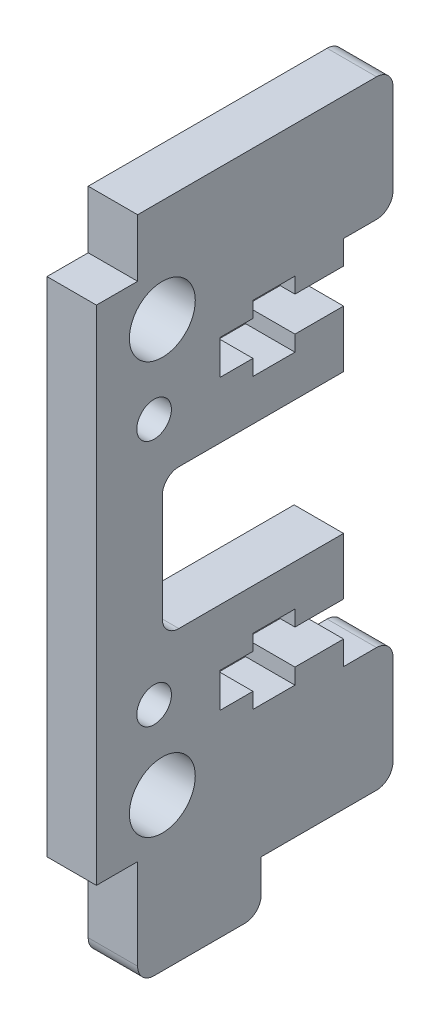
ISO-10303-21;
HEADER;
FILE_DESCRIPTION(('STEP AP214'),'2;1');
FILE_NAME('part.step','',(''),(''),'','','');
FILE_SCHEMA(('AUTOMOTIVE_DESIGN { 1 0 10303 214 1 1 1 1 }'));
ENDSEC;
DATA;
#1=APPLICATION_CONTEXT('core data for automotive mechanical design processes');
#2=APPLICATION_PROTOCOL_DEFINITION('international standard','automotive_design',2000,#1);
#3=PRODUCT_CONTEXT('',#1,'mechanical');
#4=PRODUCT('Part','Part','',(#3));
#5=PRODUCT_RELATED_PRODUCT_CATEGORY('part','',(#4));
#6=PRODUCT_DEFINITION_FORMATION('','',#4);
#7=PRODUCT_DEFINITION_CONTEXT('part definition',#1,'design');
#8=PRODUCT_DEFINITION('design','',#6,#7);
#9=PRODUCT_DEFINITION_SHAPE('','',#8);
#10=(LENGTH_UNIT() NAMED_UNIT(*) SI_UNIT(.MILLI.,.METRE.));
#11=(NAMED_UNIT(*) PLANE_ANGLE_UNIT() SI_UNIT($,.RADIAN.));
#12=(NAMED_UNIT(*) SI_UNIT($,.STERADIAN.) SOLID_ANGLE_UNIT());
#13=UNCERTAINTY_MEASURE_WITH_UNIT(LENGTH_MEASURE(1.E-05),#10,'distance_accuracy_value','');
#14=(GEOMETRIC_REPRESENTATION_CONTEXT(3) GLOBAL_UNCERTAINTY_ASSIGNED_CONTEXT((#13)) GLOBAL_UNIT_ASSIGNED_CONTEXT((#10,
#11,#12)) REPRESENTATION_CONTEXT('',''));
#15=CARTESIAN_POINT('',(0.,0.,0.));
#16=DIRECTION('',(0.,0.,1.));
#17=DIRECTION('',(1.,0.,0.));
#18=AXIS2_PLACEMENT_3D('',#15,#16,#17);
#19=CARTESIAN_POINT('',(6.,0.,-30.));
#20=DIRECTION('',(0.,0.,1.));
#21=DIRECTION('',(1.,0.,0.));
#22=AXIS2_PLACEMENT_3D('',#19,#20,#21);
#23=PLANE('',#22);
#24=DIRECTION('',(0.,1.,0.));
#25=VECTOR('',#24,1.);
#26=CARTESIAN_POINT('',(0.,0.,-30.));
#27=LINE('',#26,#25);
#28=CARTESIAN_POINT('',(0.,22.1,-30.));
#29=VERTEX_POINT('',#28);
#30=CARTESIAN_POINT('',(0.,29.,-30.));
#31=VERTEX_POINT('',#30);
#32=EDGE_CURVE('E558',#29,#31,#27,.T.);
#33=ORIENTED_EDGE('',*,*,#32,.T.);
#34=DIRECTION('',(1.,0.,0.));
#35=VECTOR('',#34,1.);
#36=CARTESIAN_POINT('',(0.,29.,-30.));
#37=LINE('',#36,#35);
#38=CARTESIAN_POINT('',(6.,29.,-30.));
#39=VERTEX_POINT('',#38);
#40=EDGE_CURVE('E433',#31,#39,#37,.T.);
#41=ORIENTED_EDGE('',*,*,#40,.T.);
#42=DIRECTION('',(0.,1.,0.));
#43=VECTOR('',#42,1.);
#44=CARTESIAN_POINT('',(6.,0.,-30.));
#45=LINE('',#44,#43);
#46=CARTESIAN_POINT('',(6.,22.1,-30.));
#47=VERTEX_POINT('',#46);
#48=EDGE_CURVE('E462',#47,#39,#45,.T.);
#49=ORIENTED_EDGE('',*,*,#48,.F.);
#50=DIRECTION('',(-1.,0.,0.));
#51=VECTOR('',#50,1.);
#52=CARTESIAN_POINT('',(6.,22.1,-30.));
#53=LINE('',#52,#51);
#54=EDGE_CURVE('E691',#47,#29,#53,.T.);
#55=ORIENTED_EDGE('',*,*,#54,.T.);
#56=EDGE_LOOP('',(#33,#41,#49,#55));
#57=FACE_BOUND('',#56,.T.);
#58=ADVANCED_FACE('F36',(#57),#23,.F.);
#59=CARTESIAN_POINT('',(6.,0.,0.));
#60=DIRECTION('',(0.,1.,0.));
#61=DIRECTION('',(0.,0.,1.));
#62=AXIS2_PLACEMENT_3D('',#59,#60,#61);
#63=PLANE('',#62);
#64=DIRECTION('',(0.,0.,-1.));
#65=VECTOR('',#64,1.);
#66=CARTESIAN_POINT('',(6.,0.,0.));
#67=LINE('',#66,#65);
#68=CARTESIAN_POINT('',(6.,0.,-20.));
#69=VERTEX_POINT('',#68);
#70=CARTESIAN_POINT('',(6.,0.,-34.));
#71=VERTEX_POINT('',#70);
#72=EDGE_CURVE('E51',#69,#71,#67,.T.);
#73=ORIENTED_EDGE('',*,*,#72,.F.);
#74=DIRECTION('',(1.,0.,0.));
#75=VECTOR('',#74,1.);
#76=CARTESIAN_POINT('',(-16.1554944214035,0.,-20.));
#77=LINE('',#76,#75);
#78=CARTESIAN_POINT('',(0.,0.,-20.));
#79=VERTEX_POINT('',#78);
#80=EDGE_CURVE('E395',#79,#69,#77,.T.);
#81=ORIENTED_EDGE('',*,*,#80,.F.);
#82=DIRECTION('',(0.,0.,-1.));
#83=VECTOR('',#82,1.);
#84=CARTESIAN_POINT('',(0.,0.,0.));
#85=LINE('',#84,#83);
#86=CARTESIAN_POINT('',(0.,0.,-34.));
#87=VERTEX_POINT('',#86);
#88=EDGE_CURVE('E436',#79,#87,#85,.T.);
#89=ORIENTED_EDGE('',*,*,#88,.T.);
#90=DIRECTION('',(-1.,0.,0.));
#91=VECTOR('',#90,1.);
#92=CARTESIAN_POINT('',(6.,0.,-34.));
#93=LINE('',#92,#91);
#94=EDGE_CURVE('E11',#71,#87,#93,.T.);
#95=ORIENTED_EDGE('',*,*,#94,.F.);
#96=EDGE_LOOP('',(#73,#81,#89,#95));
#97=FACE_BOUND('',#96,.T.);
#98=ADVANCED_FACE('F38',(#97),#63,.F.);
#99=CARTESIAN_POINT('',(6.,2.,-34.));
#100=DIRECTION('',(-1.,0.,0.));
#101=DIRECTION('',(0.,0.,1.));
#102=AXIS2_PLACEMENT_3D('',#99,#100,#101);
#103=CYLINDRICAL_SURFACE('',#102,2.);
#104=CARTESIAN_POINT('',(0.,2.,-34.));
#105=DIRECTION('',(1.,0.,0.));
#106=DIRECTION('',(0.,0.,-1.));
#107=AXIS2_PLACEMENT_3D('',#104,#105,#106);
#108=CIRCLE('',#107,2.);
#109=CARTESIAN_POINT('',(0.,2.00000000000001,-36.));
#110=VERTEX_POINT('',#109);
#111=EDGE_CURVE('E543',#87,#110,#108,.T.);
#112=ORIENTED_EDGE('',*,*,#111,.T.);
#113=DIRECTION('',(-1.,0.,0.));
#114=VECTOR('',#113,1.);
#115=CARTESIAN_POINT('',(6.,2.00000000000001,-36.));
#116=LINE('',#115,#114);
#117=CARTESIAN_POINT('',(6.,2.00000000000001,-36.));
#118=VERTEX_POINT('',#117);
#119=EDGE_CURVE('E44',#118,#110,#116,.T.);
#120=ORIENTED_EDGE('',*,*,#119,.F.);
#121=CARTESIAN_POINT('',(6.,2.,-34.));
#122=DIRECTION('',(1.,0.,0.));
#123=DIRECTION('',(0.,0.,-1.));
#124=AXIS2_PLACEMENT_3D('',#121,#122,#123);
#125=CIRCLE('',#124,2.);
#126=EDGE_CURVE('E447',#71,#118,#125,.T.);
#127=ORIENTED_EDGE('',*,*,#126,.F.);
#128=ORIENTED_EDGE('',*,*,#94,.T.);
#129=EDGE_LOOP('',(#112,#120,#127,#128));
#130=FACE_BOUND('',#129,.T.);
#131=ADVANCED_FACE('F848',(#130),#103,.T.);
#132=CARTESIAN_POINT('',(6.,0.,-36.));
#133=DIRECTION('',(0.,0.,1.));
#134=DIRECTION('',(1.,0.,0.));
#135=AXIS2_PLACEMENT_3D('',#132,#133,#134);
#136=PLANE('',#135);
#137=DIRECTION('',(0.,1.,0.));
#138=VECTOR('',#137,1.);
#139=CARTESIAN_POINT('',(0.,0.,-36.));
#140=LINE('',#139,#138);
#141=CARTESIAN_POINT('',(0.,13.,-36.));
#142=VERTEX_POINT('',#141);
#143=EDGE_CURVE('E545',#110,#142,#140,.T.);
#144=ORIENTED_EDGE('',*,*,#143,.T.);
#145=DIRECTION('',(-1.,0.,0.));
#146=VECTOR('',#145,1.);
#147=CARTESIAN_POINT('',(6.,13.,-36.));
#148=LINE('',#147,#146);
#149=CARTESIAN_POINT('',(6.,13.,-36.));
#150=VERTEX_POINT('',#149);
#151=EDGE_CURVE('E722',#150,#142,#148,.T.);
#152=ORIENTED_EDGE('',*,*,#151,.F.);
#153=DIRECTION('',(0.,1.,0.));
#154=VECTOR('',#153,1.);
#155=CARTESIAN_POINT('',(6.,0.,-36.));
#156=LINE('',#155,#154);
#157=EDGE_CURVE('E450',#118,#150,#156,.T.);
#158=ORIENTED_EDGE('',*,*,#157,.F.);
#159=ORIENTED_EDGE('',*,*,#119,.T.);
#160=EDGE_LOOP('',(#144,#152,#158,#159));
#161=FACE_BOUND('',#160,.T.);
#162=ADVANCED_FACE('F728',(#161),#136,.F.);
#163=CARTESIAN_POINT('',(6.,13.,-34.));
#164=DIRECTION('',(-1.,0.,0.));
#165=DIRECTION('',(0.,0.,1.));
#166=AXIS2_PLACEMENT_3D('',#163,#164,#165);
#167=CYLINDRICAL_SURFACE('',#166,2.);
#168=CARTESIAN_POINT('',(0.,13.,-34.));
#169=DIRECTION('',(1.,0.,0.));
#170=DIRECTION('',(0.,0.,-1.));
#171=AXIS2_PLACEMENT_3D('',#168,#169,#170);
#172=CIRCLE('',#171,2.);
#173=CARTESIAN_POINT('',(0.,15.,-34.));
#174=VERTEX_POINT('',#173);
#175=EDGE_CURVE('E548',#174,#142,#172,.F.);
#176=ORIENTED_EDGE('',*,*,#175,.F.);
#177=DIRECTION('',(-1.,0.,0.));
#178=VECTOR('',#177,1.);
#179=CARTESIAN_POINT('',(6.,15.,-34.));
#180=LINE('',#179,#178);
#181=CARTESIAN_POINT('',(6.,15.,-34.));
#182=VERTEX_POINT('',#181);
#183=EDGE_CURVE('E720',#182,#174,#180,.T.);
#184=ORIENTED_EDGE('',*,*,#183,.F.);
#185=CARTESIAN_POINT('',(6.,13.,-34.));
#186=DIRECTION('',(1.,0.,0.));
#187=DIRECTION('',(0.,0.,-1.));
#188=AXIS2_PLACEMENT_3D('',#185,#186,#187);
#189=CIRCLE('',#188,2.);
#190=EDGE_CURVE('E452',#182,#150,#189,.F.);
#191=ORIENTED_EDGE('',*,*,#190,.T.);
#192=ORIENTED_EDGE('',*,*,#151,.T.);
#193=EDGE_LOOP('',(#176,#184,#191,#192));
#194=FACE_BOUND('',#193,.T.);
#195=ADVANCED_FACE('F740',(#194),#167,.T.);
#196=CARTESIAN_POINT('',(6.,15.,0.));
#197=DIRECTION('',(0.,1.,0.));
#198=DIRECTION('',(0.,0.,1.));
#199=AXIS2_PLACEMENT_3D('',#196,#197,#198);
#200=PLANE('',#199);
#201=DIRECTION('',(0.,0.,-1.));
#202=VECTOR('',#201,1.);
#203=CARTESIAN_POINT('',(0.,15.,0.));
#204=LINE('',#203,#202);
#205=CARTESIAN_POINT('',(0.,15.,-30.));
#206=VERTEX_POINT('',#205);
#207=EDGE_CURVE('E551',#206,#174,#204,.T.);
#208=ORIENTED_EDGE('',*,*,#207,.F.);
#209=DIRECTION('',(-1.,0.,0.));
#210=VECTOR('',#209,1.);
#211=CARTESIAN_POINT('',(6.,15.,-30.));
#212=LINE('',#211,#210);
#213=CARTESIAN_POINT('',(6.,15.,-30.));
#214=VERTEX_POINT('',#213);
#215=EDGE_CURVE('E718',#214,#206,#212,.T.);
#216=ORIENTED_EDGE('',*,*,#215,.F.);
#217=DIRECTION('',(0.,0.,-1.));
#218=VECTOR('',#217,1.);
#219=CARTESIAN_POINT('',(6.,15.,0.));
#220=LINE('',#219,#218);
#221=EDGE_CURVE('E455',#214,#182,#220,.T.);
#222=ORIENTED_EDGE('',*,*,#221,.T.);
#223=ORIENTED_EDGE('',*,*,#183,.T.);
#224=EDGE_LOOP('',(#208,#216,#222,#223));
#225=FACE_BOUND('',#224,.T.);
#226=ADVANCED_FACE('F744',(#225),#200,.T.);
#227=CARTESIAN_POINT('',(0.,17.9,-30.));
#228=VERTEX_POINT('',#227);
#229=EDGE_CURVE('E554',#206,#228,#27,.T.);
#230=ORIENTED_EDGE('',*,*,#229,.T.);
#231=DIRECTION('',(-1.,0.,0.));
#232=VECTOR('',#231,1.);
#233=CARTESIAN_POINT('',(6.,17.9,-30.));
#234=LINE('',#233,#232);
#235=CARTESIAN_POINT('',(6.,17.9,-30.));
#236=VERTEX_POINT('',#235);
#237=EDGE_CURVE('E715',#236,#228,#234,.T.);
#238=ORIENTED_EDGE('',*,*,#237,.F.);
#239=EDGE_CURVE('E458',#214,#236,#45,.T.);
#240=ORIENTED_EDGE('',*,*,#239,.F.);
#241=ORIENTED_EDGE('',*,*,#215,.T.);
#242=EDGE_LOOP('',(#230,#238,#240,#241));
#243=FACE_BOUND('',#242,.T.);
#244=ADVANCED_FACE('F748',(#243),#23,.F.);
#245=CARTESIAN_POINT('',(6.,17.9,0.));
#246=DIRECTION('',(0.,-1.,0.));
#247=DIRECTION('',(0.,0.,-1.));
#248=AXIS2_PLACEMENT_3D('',#245,#246,#247);
#249=PLANE('',#248);
#250=DIRECTION('',(0.,0.,1.));
#251=VECTOR('',#250,1.);
#252=CARTESIAN_POINT('',(0.,17.9,0.));
#253=LINE('',#252,#251);
#254=CARTESIAN_POINT('',(0.,17.9,-24.1));
#255=VERTEX_POINT('',#254);
#256=EDGE_CURVE('E556',#228,#255,#253,.T.);
#257=ORIENTED_EDGE('',*,*,#256,.T.);
#258=DIRECTION('',(-1.,0.,0.));
#259=VECTOR('',#258,1.);
#260=CARTESIAN_POINT('',(6.,17.9,-24.1));
#261=LINE('',#260,#259);
#262=CARTESIAN_POINT('',(6.,17.9,-24.1));
#263=VERTEX_POINT('',#262);
#264=EDGE_CURVE('E712',#263,#255,#261,.T.);
#265=ORIENTED_EDGE('',*,*,#264,.F.);
#266=DIRECTION('',(0.,0.,1.));
#267=VECTOR('',#266,1.);
#268=CARTESIAN_POINT('',(6.,17.9,0.));
#269=LINE('',#268,#267);
#270=EDGE_CURVE('E460',#236,#263,#269,.T.);
#271=ORIENTED_EDGE('',*,*,#270,.F.);
#272=ORIENTED_EDGE('',*,*,#237,.T.);
#273=EDGE_LOOP('',(#257,#265,#271,#272));
#274=FACE_BOUND('',#273,.T.);
#275=ADVANCED_FACE('F755',(#274),#249,.F.);
#276=CARTESIAN_POINT('',(6.,0.,-24.1));
#277=DIRECTION('',(0.,0.,-1.));
#278=DIRECTION('',(-1.,0.,0.));
#279=AXIS2_PLACEMENT_3D('',#276,#277,#278);
#280=PLANE('',#279);
#281=DIRECTION('',(0.,-1.,0.));
#282=VECTOR('',#281,1.);
#283=CARTESIAN_POINT('',(0.,0.,-24.1));
#284=LINE('',#283,#282);
#285=CARTESIAN_POINT('',(0.,16.,-24.1));
#286=VERTEX_POINT('',#285);
#287=EDGE_CURVE('E560',#255,#286,#284,.T.);
#288=ORIENTED_EDGE('',*,*,#287,.T.);
#289=DIRECTION('',(-1.,0.,0.));
#290=VECTOR('',#289,1.);
#291=CARTESIAN_POINT('',(6.,16.,-24.1));
#292=LINE('',#291,#290);
#293=CARTESIAN_POINT('',(6.,16.,-24.1));
#294=VERTEX_POINT('',#293);
#295=EDGE_CURVE('E710',#294,#286,#292,.T.);
#296=ORIENTED_EDGE('',*,*,#295,.F.);
#297=DIRECTION('',(0.,-1.,0.));
#298=VECTOR('',#297,1.);
#299=CARTESIAN_POINT('',(6.,0.,-24.1));
#300=LINE('',#299,#298);
#301=EDGE_CURVE('E464',#263,#294,#300,.T.);
#302=ORIENTED_EDGE('',*,*,#301,.F.);
#303=ORIENTED_EDGE('',*,*,#264,.T.);
#304=EDGE_LOOP('',(#288,#296,#302,#303));
#305=FACE_BOUND('',#304,.T.);
#306=ADVANCED_FACE('F759',(#305),#280,.F.);
#307=CARTESIAN_POINT('',(6.,16.,0.));
#308=DIRECTION('',(0.,1.,0.));
#309=DIRECTION('',(0.,0.,1.));
#310=AXIS2_PLACEMENT_3D('',#307,#308,#309);
#311=PLANE('',#310);
#312=DIRECTION('',(0.,0.,-1.));
#313=VECTOR('',#312,1.);
#314=CARTESIAN_POINT('',(0.,16.,0.));
#315=LINE('',#314,#313);
#316=CARTESIAN_POINT('',(0.,16.,-19.));
#317=VERTEX_POINT('',#316);
#318=EDGE_CURVE('E564',#317,#286,#315,.T.);
#319=ORIENTED_EDGE('',*,*,#318,.F.);
#320=DIRECTION('',(-1.,0.,0.));
#321=VECTOR('',#320,1.);
#322=CARTESIAN_POINT('',(6.,16.,-19.));
#323=LINE('',#322,#321);
#324=CARTESIAN_POINT('',(6.,16.,-19.));
#325=VERTEX_POINT('',#324);
#326=EDGE_CURVE('E708',#325,#317,#323,.T.);
#327=ORIENTED_EDGE('',*,*,#326,.F.);
#328=DIRECTION('',(0.,0.,-1.));
#329=VECTOR('',#328,1.);
#330=CARTESIAN_POINT('',(6.,16.,0.));
#331=LINE('',#330,#329);
#332=EDGE_CURVE('E467',#325,#294,#331,.T.);
#333=ORIENTED_EDGE('',*,*,#332,.T.);
#334=ORIENTED_EDGE('',*,*,#295,.T.);
#335=EDGE_LOOP('',(#319,#327,#333,#334));
#336=FACE_BOUND('',#335,.T.);
#337=ADVANCED_FACE('F762',(#336),#311,.T.);
#338=CARTESIAN_POINT('',(6.,0.,-19.));
#339=DIRECTION('',(0.,0.,-1.));
#340=DIRECTION('',(-1.,0.,0.));
#341=AXIS2_PLACEMENT_3D('',#338,#339,#340);
#342=PLANE('',#341);
#343=DIRECTION('',(0.,-1.,0.));
#344=VECTOR('',#343,1.);
#345=CARTESIAN_POINT('',(0.,0.,-19.));
#346=LINE('',#345,#344);
#347=CARTESIAN_POINT('',(0.,17.9,-19.));
#348=VERTEX_POINT('',#347);
#349=EDGE_CURVE('E568',#348,#317,#346,.T.);
#350=ORIENTED_EDGE('',*,*,#349,.F.);
#351=DIRECTION('',(-1.,0.,0.));
#352=VECTOR('',#351,1.);
#353=CARTESIAN_POINT('',(6.,17.9,-19.));
#354=LINE('',#353,#352);
#355=CARTESIAN_POINT('',(6.,17.9,-19.));
#356=VERTEX_POINT('',#355);
#357=EDGE_CURVE('E706',#356,#348,#354,.T.);
#358=ORIENTED_EDGE('',*,*,#357,.F.);
#359=DIRECTION('',(0.,-1.,0.));
#360=VECTOR('',#359,1.);
#361=CARTESIAN_POINT('',(6.,0.,-19.));
#362=LINE('',#361,#360);
#363=EDGE_CURVE('E471',#356,#325,#362,.T.);
#364=ORIENTED_EDGE('',*,*,#363,.T.);
#365=ORIENTED_EDGE('',*,*,#326,.T.);
#366=EDGE_LOOP('',(#350,#358,#364,#365));
#367=FACE_BOUND('',#366,.T.);
#368=ADVANCED_FACE('F766',(#367),#342,.T.);
#369=CARTESIAN_POINT('',(0.,17.9,-15.));
#370=VERTEX_POINT('',#369);
#371=EDGE_CURVE('E561',#348,#370,#253,.T.);
#372=ORIENTED_EDGE('',*,*,#371,.T.);
#373=DIRECTION('',(-1.,0.,0.));
#374=VECTOR('',#373,1.);
#375=CARTESIAN_POINT('',(6.,17.9,-15.));
#376=LINE('',#375,#374);
#377=CARTESIAN_POINT('',(6.,17.9,-15.));
#378=VERTEX_POINT('',#377);
#379=EDGE_CURVE('E704',#378,#370,#376,.T.);
#380=ORIENTED_EDGE('',*,*,#379,.F.);
#381=EDGE_CURVE('E465',#356,#378,#269,.T.);
#382=ORIENTED_EDGE('',*,*,#381,.F.);
#383=ORIENTED_EDGE('',*,*,#357,.T.);
#384=EDGE_LOOP('',(#372,#380,#382,#383));
#385=FACE_BOUND('',#384,.T.);
#386=ADVANCED_FACE('F772',(#385),#249,.F.);
#387=CARTESIAN_POINT('',(6.,0.,-15.));
#388=DIRECTION('',(0.,0.,-1.));
#389=DIRECTION('',(-1.,0.,0.));
#390=AXIS2_PLACEMENT_3D('',#387,#388,#389);
#391=PLANE('',#390);
#392=DIRECTION('',(0.,-1.,0.));
#393=VECTOR('',#392,1.);
#394=CARTESIAN_POINT('',(0.,0.,-15.));
#395=LINE('',#394,#393);
#396=CARTESIAN_POINT('',(0.,22.1,-15.));
#397=VERTEX_POINT('',#396);
#398=EDGE_CURVE('E572',#397,#370,#395,.T.);
#399=ORIENTED_EDGE('',*,*,#398,.F.);
#400=DIRECTION('',(-1.,0.,0.));
#401=VECTOR('',#400,1.);
#402=CARTESIAN_POINT('',(6.,22.1,-15.));
#403=LINE('',#402,#401);
#404=CARTESIAN_POINT('',(6.,22.1,-15.));
#405=VERTEX_POINT('',#404);
#406=EDGE_CURVE('E702',#405,#397,#403,.T.);
#407=ORIENTED_EDGE('',*,*,#406,.F.);
#408=DIRECTION('',(0.,-1.,0.));
#409=VECTOR('',#408,1.);
#410=CARTESIAN_POINT('',(6.,0.,-15.));
#411=LINE('',#410,#409);
#412=EDGE_CURVE('E475',#405,#378,#411,.T.);
#413=ORIENTED_EDGE('',*,*,#412,.T.);
#414=ORIENTED_EDGE('',*,*,#379,.T.);
#415=EDGE_LOOP('',(#399,#407,#413,#414));
#416=FACE_BOUND('',#415,.T.);
#417=ADVANCED_FACE('F830',(#416),#391,.T.);
#418=CARTESIAN_POINT('',(6.,22.1,0.));
#419=DIRECTION('',(0.,-1.,0.));
#420=DIRECTION('',(0.,0.,-1.));
#421=AXIS2_PLACEMENT_3D('',#418,#419,#420);
#422=PLANE('',#421);
#423=DIRECTION('',(0.,0.,1.));
#424=VECTOR('',#423,1.);
#425=CARTESIAN_POINT('',(0.,22.1,0.));
#426=LINE('',#425,#424);
#427=CARTESIAN_POINT('',(0.,22.1,-19.));
#428=VERTEX_POINT('',#427);
#429=EDGE_CURVE('E575',#428,#397,#426,.T.);
#430=ORIENTED_EDGE('',*,*,#429,.F.);
#431=DIRECTION('',(-1.,0.,0.));
#432=VECTOR('',#431,1.);
#433=CARTESIAN_POINT('',(6.,22.1,-19.));
#434=LINE('',#433,#432);
#435=CARTESIAN_POINT('',(6.,22.1,-19.));
#436=VERTEX_POINT('',#435);
#437=EDGE_CURVE('E700',#436,#428,#434,.T.);
#438=ORIENTED_EDGE('',*,*,#437,.F.);
#439=DIRECTION('',(0.,0.,1.));
#440=VECTOR('',#439,1.);
#441=CARTESIAN_POINT('',(6.,22.1,0.));
#442=LINE('',#441,#440);
#443=EDGE_CURVE('E478',#436,#405,#442,.T.);
#444=ORIENTED_EDGE('',*,*,#443,.T.);
#445=ORIENTED_EDGE('',*,*,#406,.T.);
#446=EDGE_LOOP('',(#430,#438,#444,#445));
#447=FACE_BOUND('',#446,.T.);
#448=ADVANCED_FACE('F780',(#447),#422,.T.);
#449=CARTESIAN_POINT('',(0.,24.,-19.));
#450=VERTEX_POINT('',#449);
#451=EDGE_CURVE('E571',#450,#428,#346,.T.);
#452=ORIENTED_EDGE('',*,*,#451,.F.);
#453=DIRECTION('',(-1.,0.,0.));
#454=VECTOR('',#453,1.);
#455=CARTESIAN_POINT('',(6.,24.,-19.));
#456=LINE('',#455,#454);
#457=CARTESIAN_POINT('',(6.,24.,-19.));
#458=VERTEX_POINT('',#457);
#459=EDGE_CURVE('E698',#458,#450,#456,.T.);
#460=ORIENTED_EDGE('',*,*,#459,.F.);
#461=EDGE_CURVE('E474',#458,#436,#362,.T.);
#462=ORIENTED_EDGE('',*,*,#461,.T.);
#463=ORIENTED_EDGE('',*,*,#437,.T.);
#464=EDGE_LOOP('',(#452,#460,#462,#463));
#465=FACE_BOUND('',#464,.T.);
#466=ADVANCED_FACE('F785',(#465),#342,.T.);
#467=CARTESIAN_POINT('',(6.,24.,0.));
#468=DIRECTION('',(0.,1.,0.));
#469=DIRECTION('',(0.,0.,1.));
#470=AXIS2_PLACEMENT_3D('',#467,#468,#469);
#471=PLANE('',#470);
#472=DIRECTION('',(0.,0.,-1.));
#473=VECTOR('',#472,1.);
#474=CARTESIAN_POINT('',(0.,24.,0.));
#475=LINE('',#474,#473);
#476=CARTESIAN_POINT('',(0.,24.,-24.1));
#477=VERTEX_POINT('',#476);
#478=EDGE_CURVE('E579',#450,#477,#475,.T.);
#479=ORIENTED_EDGE('',*,*,#478,.T.);
#480=DIRECTION('',(-1.,0.,0.));
#481=VECTOR('',#480,1.);
#482=CARTESIAN_POINT('',(6.,24.,-24.1));
#483=LINE('',#482,#481);
#484=CARTESIAN_POINT('',(6.,24.,-24.1));
#485=VERTEX_POINT('',#484);
#486=EDGE_CURVE('E695',#485,#477,#483,.T.);
#487=ORIENTED_EDGE('',*,*,#486,.F.);
#488=DIRECTION('',(0.,0.,-1.));
#489=VECTOR('',#488,1.);
#490=CARTESIAN_POINT('',(6.,24.,0.));
#491=LINE('',#490,#489);
#492=EDGE_CURVE('E482',#458,#485,#491,.T.);
#493=ORIENTED_EDGE('',*,*,#492,.F.);
#494=ORIENTED_EDGE('',*,*,#459,.T.);
#495=EDGE_LOOP('',(#479,#487,#493,#494));
#496=FACE_BOUND('',#495,.T.);
#497=ADVANCED_FACE('F792',(#496),#471,.F.);
#498=CARTESIAN_POINT('',(0.,22.1,-24.1));
#499=VERTEX_POINT('',#498);
#500=EDGE_CURVE('E565',#477,#499,#284,.T.);
#501=ORIENTED_EDGE('',*,*,#500,.T.);
#502=DIRECTION('',(-1.,0.,0.));
#503=VECTOR('',#502,1.);
#504=CARTESIAN_POINT('',(6.,22.1,-24.1));
#505=LINE('',#504,#503);
#506=CARTESIAN_POINT('',(6.,22.1,-24.1));
#507=VERTEX_POINT('',#506);
#508=EDGE_CURVE('E693',#507,#499,#505,.T.);
#509=ORIENTED_EDGE('',*,*,#508,.F.);
#510=EDGE_CURVE('E468',#485,#507,#300,.T.);
#511=ORIENTED_EDGE('',*,*,#510,.F.);
#512=ORIENTED_EDGE('',*,*,#486,.T.);
#513=EDGE_LOOP('',(#501,#509,#511,#512));
#514=FACE_BOUND('',#513,.T.);
#515=ADVANCED_FACE('F797',(#514),#280,.F.);
#516=EDGE_CURVE('E578',#29,#499,#426,.T.);
#517=ORIENTED_EDGE('',*,*,#516,.F.);
#518=ORIENTED_EDGE('',*,*,#54,.F.);
#519=EDGE_CURVE('E481',#47,#507,#442,.T.);
#520=ORIENTED_EDGE('',*,*,#519,.T.);
#521=ORIENTED_EDGE('',*,*,#508,.T.);
#522=EDGE_LOOP('',(#517,#518,#520,#521));
#523=FACE_BOUND('',#522,.T.);
#524=ADVANCED_FACE('F838',(#523),#422,.T.);
#525=CARTESIAN_POINT('',(6.,46.,-30.));
#526=VERTEX_POINT('',#525);
#527=CARTESIAN_POINT('',(6.,52.9,-30.));
#528=VERTEX_POINT('',#527);
#529=EDGE_CURVE('E461',#526,#528,#45,.T.);
#530=ORIENTED_EDGE('',*,*,#529,.F.);
#531=DIRECTION('',(1.,0.,0.));
#532=VECTOR('',#531,1.);
#533=CARTESIAN_POINT('',(0.,46.,-30.));
#534=LINE('',#533,#532);
#535=CARTESIAN_POINT('',(0.,46.,-30.));
#536=VERTEX_POINT('',#535);
#537=EDGE_CURVE('E420',#536,#526,#534,.T.);
#538=ORIENTED_EDGE('',*,*,#537,.F.);
#539=CARTESIAN_POINT('',(0.,52.9,-30.));
#540=VERTEX_POINT('',#539);
#541=EDGE_CURVE('E557',#536,#540,#27,.T.);
#542=ORIENTED_EDGE('',*,*,#541,.T.);
#543=DIRECTION('',(-1.,0.,0.));
#544=VECTOR('',#543,1.);
#545=CARTESIAN_POINT('',(6.,52.9,-30.));
#546=LINE('',#545,#544);
#547=EDGE_CURVE('E688',#528,#540,#546,.T.);
#548=ORIENTED_EDGE('',*,*,#547,.F.);
#549=EDGE_LOOP('',(#530,#538,#542,#548));
#550=FACE_BOUND('',#549,.T.);
#551=ADVANCED_FACE('F852',(#550),#23,.F.);
#552=CARTESIAN_POINT('',(6.,52.9,0.));
#553=DIRECTION('',(0.,-1.,0.));
#554=DIRECTION('',(0.,0.,-1.));
#555=AXIS2_PLACEMENT_3D('',#552,#553,#554);
#556=PLANE('',#555);
#557=DIRECTION('',(0.,0.,1.));
#558=VECTOR('',#557,1.);
#559=CARTESIAN_POINT('',(0.,52.9,0.));
#560=LINE('',#559,#558);
#561=CARTESIAN_POINT('',(0.,52.9,-24.1));
#562=VERTEX_POINT('',#561);
#563=EDGE_CURVE('E581',#540,#562,#560,.T.);
#564=ORIENTED_EDGE('',*,*,#563,.T.);
#565=DIRECTION('',(-1.,0.,0.));
#566=VECTOR('',#565,1.);
#567=CARTESIAN_POINT('',(6.,52.9,-24.1));
#568=LINE('',#567,#566);
#569=CARTESIAN_POINT('',(6.,52.9,-24.1));
#570=VERTEX_POINT('',#569);
#571=EDGE_CURVE('E685',#570,#562,#568,.T.);
#572=ORIENTED_EDGE('',*,*,#571,.F.);
#573=DIRECTION('',(0.,0.,1.));
#574=VECTOR('',#573,1.);
#575=CARTESIAN_POINT('',(6.,52.9,0.));
#576=LINE('',#575,#574);
#577=EDGE_CURVE('E484',#528,#570,#576,.T.);
#578=ORIENTED_EDGE('',*,*,#577,.F.);
#579=ORIENTED_EDGE('',*,*,#547,.T.);
#580=EDGE_LOOP('',(#564,#572,#578,#579));
#581=FACE_BOUND('',#580,.T.);
#582=ADVANCED_FACE('F863',(#581),#556,.F.);
#583=CARTESIAN_POINT('',(6.,0.,-24.1));
#584=DIRECTION('',(0.,0.,-1.));
#585=DIRECTION('',(-1.,0.,0.));
#586=AXIS2_PLACEMENT_3D('',#583,#584,#585);
#587=PLANE('',#586);
#588=DIRECTION('',(0.,-1.,0.));
#589=VECTOR('',#588,1.);
#590=CARTESIAN_POINT('',(0.,0.,-24.1));
#591=LINE('',#590,#589);
#592=CARTESIAN_POINT('',(0.,51.,-24.1));
#593=VERTEX_POINT('',#592);
#594=EDGE_CURVE('E583',#562,#593,#591,.T.);
#595=ORIENTED_EDGE('',*,*,#594,.T.);
#596=DIRECTION('',(-1.,0.,0.));
#597=VECTOR('',#596,1.);
#598=CARTESIAN_POINT('',(6.,51.,-24.1));
#599=LINE('',#598,#597);
#600=CARTESIAN_POINT('',(6.,51.,-24.1));
#601=VERTEX_POINT('',#600);
#602=EDGE_CURVE('E683',#601,#593,#599,.T.);
#603=ORIENTED_EDGE('',*,*,#602,.F.);
#604=DIRECTION('',(0.,-1.,0.));
#605=VECTOR('',#604,1.);
#606=CARTESIAN_POINT('',(6.,0.,-24.1));
#607=LINE('',#606,#605);
#608=EDGE_CURVE('E486',#570,#601,#607,.T.);
#609=ORIENTED_EDGE('',*,*,#608,.F.);
#610=ORIENTED_EDGE('',*,*,#571,.T.);
#611=EDGE_LOOP('',(#595,#603,#609,#610));
#612=FACE_BOUND('',#611,.T.);
#613=ADVANCED_FACE('F868',(#612),#587,.F.);
#614=CARTESIAN_POINT('',(6.,51.,0.));
#615=DIRECTION('',(0.,1.,0.));
#616=DIRECTION('',(0.,0.,1.));
#617=AXIS2_PLACEMENT_3D('',#614,#615,#616);
#618=PLANE('',#617);
#619=DIRECTION('',(0.,0.,-1.));
#620=VECTOR('',#619,1.);
#621=CARTESIAN_POINT('',(0.,51.,0.));
#622=LINE('',#621,#620);
#623=CARTESIAN_POINT('',(0.,51.,-19.));
#624=VERTEX_POINT('',#623);
#625=EDGE_CURVE('E587',#624,#593,#622,.T.);
#626=ORIENTED_EDGE('',*,*,#625,.F.);
#627=DIRECTION('',(-1.,0.,0.));
#628=VECTOR('',#627,1.);
#629=CARTESIAN_POINT('',(6.,51.,-19.));
#630=LINE('',#629,#628);
#631=CARTESIAN_POINT('',(6.,51.,-19.));
#632=VERTEX_POINT('',#631);
#633=EDGE_CURVE('E681',#632,#624,#630,.T.);
#634=ORIENTED_EDGE('',*,*,#633,.F.);
#635=DIRECTION('',(0.,0.,-1.));
#636=VECTOR('',#635,1.);
#637=CARTESIAN_POINT('',(6.,51.,0.));
#638=LINE('',#637,#636);
#639=EDGE_CURVE('E489',#632,#601,#638,.T.);
#640=ORIENTED_EDGE('',*,*,#639,.T.);
#641=ORIENTED_EDGE('',*,*,#602,.T.);
#642=EDGE_LOOP('',(#626,#634,#640,#641));
#643=FACE_BOUND('',#642,.T.);
#644=ADVANCED_FACE('F883',(#643),#618,.T.);
#645=CARTESIAN_POINT('',(6.,0.,-19.));
#646=DIRECTION('',(0.,0.,-1.));
#647=DIRECTION('',(-1.,0.,0.));
#648=AXIS2_PLACEMENT_3D('',#645,#646,#647);
#649=PLANE('',#648);
#650=DIRECTION('',(0.,-1.,0.));
#651=VECTOR('',#650,1.);
#652=CARTESIAN_POINT('',(0.,0.,-19.));
#653=LINE('',#652,#651);
#654=CARTESIAN_POINT('',(0.,52.9,-19.));
#655=VERTEX_POINT('',#654);
#656=EDGE_CURVE('E591',#655,#624,#653,.T.);
#657=ORIENTED_EDGE('',*,*,#656,.F.);
#658=DIRECTION('',(-1.,0.,0.));
#659=VECTOR('',#658,1.);
#660=CARTESIAN_POINT('',(6.,52.9,-19.));
#661=LINE('',#660,#659);
#662=CARTESIAN_POINT('',(6.,52.9,-19.));
#663=VERTEX_POINT('',#662);
#664=EDGE_CURVE('E679',#663,#655,#661,.T.);
#665=ORIENTED_EDGE('',*,*,#664,.F.);
#666=DIRECTION('',(0.,-1.,0.));
#667=VECTOR('',#666,1.);
#668=CARTESIAN_POINT('',(6.,0.,-19.));
#669=LINE('',#668,#667);
#670=EDGE_CURVE('E493',#663,#632,#669,.T.);
#671=ORIENTED_EDGE('',*,*,#670,.T.);
#672=ORIENTED_EDGE('',*,*,#633,.T.);
#673=EDGE_LOOP('',(#657,#665,#671,#672));
#674=FACE_BOUND('',#673,.T.);
#675=ADVANCED_FACE('F886',(#674),#649,.T.);
#676=CARTESIAN_POINT('',(0.,52.9,-15.));
#677=VERTEX_POINT('',#676);
#678=EDGE_CURVE('E584',#655,#677,#560,.T.);
#679=ORIENTED_EDGE('',*,*,#678,.T.);
#680=DIRECTION('',(-1.,0.,0.));
#681=VECTOR('',#680,1.);
#682=CARTESIAN_POINT('',(6.,52.9,-15.));
#683=LINE('',#682,#681);
#684=CARTESIAN_POINT('',(6.,52.9,-15.));
#685=VERTEX_POINT('',#684);
#686=EDGE_CURVE('E677',#685,#677,#683,.T.);
#687=ORIENTED_EDGE('',*,*,#686,.F.);
#688=EDGE_CURVE('E487',#663,#685,#576,.T.);
#689=ORIENTED_EDGE('',*,*,#688,.F.);
#690=ORIENTED_EDGE('',*,*,#664,.T.);
#691=EDGE_LOOP('',(#679,#687,#689,#690));
#692=FACE_BOUND('',#691,.T.);
#693=ADVANCED_FACE('F871',(#692),#556,.F.);
#694=CARTESIAN_POINT('',(6.,0.,-15.));
#695=DIRECTION('',(0.,0.,-1.));
#696=DIRECTION('',(-1.,0.,0.));
#697=AXIS2_PLACEMENT_3D('',#694,#695,#696);
#698=PLANE('',#697);
#699=DIRECTION('',(0.,-1.,0.));
#700=VECTOR('',#699,1.);
#701=CARTESIAN_POINT('',(0.,0.,-15.));
#702=LINE('',#701,#700);
#703=CARTESIAN_POINT('',(0.,57.1,-15.));
#704=VERTEX_POINT('',#703);
#705=EDGE_CURVE('E595',#704,#677,#702,.T.);
#706=ORIENTED_EDGE('',*,*,#705,.F.);
#707=DIRECTION('',(-1.,0.,0.));
#708=VECTOR('',#707,1.);
#709=CARTESIAN_POINT('',(6.,57.1,-15.));
#710=LINE('',#709,#708);
#711=CARTESIAN_POINT('',(6.,57.1,-15.));
#712=VERTEX_POINT('',#711);
#713=EDGE_CURVE('E675',#712,#704,#710,.T.);
#714=ORIENTED_EDGE('',*,*,#713,.F.);
#715=DIRECTION('',(0.,-1.,0.));
#716=VECTOR('',#715,1.);
#717=CARTESIAN_POINT('',(6.,0.,-15.));
#718=LINE('',#717,#716);
#719=EDGE_CURVE('E497',#712,#685,#718,.T.);
#720=ORIENTED_EDGE('',*,*,#719,.T.);
#721=ORIENTED_EDGE('',*,*,#686,.T.);
#722=EDGE_LOOP('',(#706,#714,#720,#721));
#723=FACE_BOUND('',#722,.T.);
#724=ADVANCED_FACE('F896',(#723),#698,.T.);
#725=CARTESIAN_POINT('',(6.,57.1,0.));
#726=DIRECTION('',(0.,-1.,0.));
#727=DIRECTION('',(0.,0.,-1.));
#728=AXIS2_PLACEMENT_3D('',#725,#726,#727);
#729=PLANE('',#728);
#730=DIRECTION('',(0.,0.,1.));
#731=VECTOR('',#730,1.);
#732=CARTESIAN_POINT('',(0.,57.1,0.));
#733=LINE('',#732,#731);
#734=CARTESIAN_POINT('',(0.,57.1,-19.));
#735=VERTEX_POINT('',#734);
#736=EDGE_CURVE('E598',#735,#704,#733,.T.);
#737=ORIENTED_EDGE('',*,*,#736,.F.);
#738=DIRECTION('',(-1.,0.,0.));
#739=VECTOR('',#738,1.);
#740=CARTESIAN_POINT('',(6.,57.1,-19.));
#741=LINE('',#740,#739);
#742=CARTESIAN_POINT('',(6.,57.1,-19.));
#743=VERTEX_POINT('',#742);
#744=EDGE_CURVE('E673',#743,#735,#741,.T.);
#745=ORIENTED_EDGE('',*,*,#744,.F.);
#746=DIRECTION('',(0.,0.,1.));
#747=VECTOR('',#746,1.);
#748=CARTESIAN_POINT('',(6.,57.1,0.));
#749=LINE('',#748,#747);
#750=EDGE_CURVE('E500',#743,#712,#749,.T.);
#751=ORIENTED_EDGE('',*,*,#750,.T.);
#752=ORIENTED_EDGE('',*,*,#713,.T.);
#753=EDGE_LOOP('',(#737,#745,#751,#752));
#754=FACE_BOUND('',#753,.T.);
#755=ADVANCED_FACE('F861',(#754),#729,.T.);
#756=CARTESIAN_POINT('',(0.,59.,-19.));
#757=VERTEX_POINT('',#756);
#758=EDGE_CURVE('E594',#757,#735,#653,.T.);
#759=ORIENTED_EDGE('',*,*,#758,.F.);
#760=DIRECTION('',(-1.,0.,0.));
#761=VECTOR('',#760,1.);
#762=CARTESIAN_POINT('',(6.,59.,-19.));
#763=LINE('',#762,#761);
#764=CARTESIAN_POINT('',(6.,59.,-19.));
#765=VERTEX_POINT('',#764);
#766=EDGE_CURVE('E671',#765,#757,#763,.T.);
#767=ORIENTED_EDGE('',*,*,#766,.F.);
#768=EDGE_CURVE('E496',#765,#743,#669,.T.);
#769=ORIENTED_EDGE('',*,*,#768,.T.);
#770=ORIENTED_EDGE('',*,*,#744,.T.);
#771=EDGE_LOOP('',(#759,#767,#769,#770));
#772=FACE_BOUND('',#771,.T.);
#773=ADVANCED_FACE('F903',(#772),#649,.T.);
#774=CARTESIAN_POINT('',(6.,59.,0.));
#775=DIRECTION('',(0.,1.,0.));
#776=DIRECTION('',(0.,0.,1.));
#777=AXIS2_PLACEMENT_3D('',#774,#775,#776);
#778=PLANE('',#777);
#779=DIRECTION('',(0.,0.,-1.));
#780=VECTOR('',#779,1.);
#781=CARTESIAN_POINT('',(0.,59.,0.));
#782=LINE('',#781,#780);
#783=CARTESIAN_POINT('',(0.,59.,-24.1));
#784=VERTEX_POINT('',#783);
#785=EDGE_CURVE('E602',#757,#784,#782,.T.);
#786=ORIENTED_EDGE('',*,*,#785,.T.);
#787=DIRECTION('',(-1.,0.,0.));
#788=VECTOR('',#787,1.);
#789=CARTESIAN_POINT('',(6.,59.,-24.1));
#790=LINE('',#789,#788);
#791=CARTESIAN_POINT('',(6.,59.,-24.1));
#792=VERTEX_POINT('',#791);
#793=EDGE_CURVE('E668',#792,#784,#790,.T.);
#794=ORIENTED_EDGE('',*,*,#793,.F.);
#795=DIRECTION('',(0.,0.,-1.));
#796=VECTOR('',#795,1.);
#797=CARTESIAN_POINT('',(6.,59.,0.));
#798=LINE('',#797,#796);
#799=EDGE_CURVE('E504',#765,#792,#798,.T.);
#800=ORIENTED_EDGE('',*,*,#799,.F.);
#801=ORIENTED_EDGE('',*,*,#766,.T.);
#802=EDGE_LOOP('',(#786,#794,#800,#801));
#803=FACE_BOUND('',#802,.T.);
#804=ADVANCED_FACE('F906',(#803),#778,.F.);
#805=CARTESIAN_POINT('',(0.,57.1,-24.1));
#806=VERTEX_POINT('',#805);
#807=EDGE_CURVE('E588',#784,#806,#591,.T.);
#808=ORIENTED_EDGE('',*,*,#807,.T.);
#809=DIRECTION('',(-1.,0.,0.));
#810=VECTOR('',#809,1.);
#811=CARTESIAN_POINT('',(6.,57.1,-24.1));
#812=LINE('',#811,#810);
#813=CARTESIAN_POINT('',(6.,57.1,-24.1));
#814=VERTEX_POINT('',#813);
#815=EDGE_CURVE('E666',#814,#806,#812,.T.);
#816=ORIENTED_EDGE('',*,*,#815,.F.);
#817=EDGE_CURVE('E490',#792,#814,#607,.T.);
#818=ORIENTED_EDGE('',*,*,#817,.F.);
#819=ORIENTED_EDGE('',*,*,#793,.T.);
#820=EDGE_LOOP('',(#808,#816,#818,#819));
#821=FACE_BOUND('',#820,.T.);
#822=ADVANCED_FACE('F816',(#821),#587,.F.);
#823=CARTESIAN_POINT('',(0.,57.1,-30.));
#824=VERTEX_POINT('',#823);
#825=EDGE_CURVE('E601',#824,#806,#733,.T.);
#826=ORIENTED_EDGE('',*,*,#825,.F.);
#827=DIRECTION('',(-1.,0.,0.));
#828=VECTOR('',#827,1.);
#829=CARTESIAN_POINT('',(6.,57.1,-30.));
#830=LINE('',#829,#828);
#831=CARTESIAN_POINT('',(6.,57.1,-30.));
#832=VERTEX_POINT('',#831);
#833=EDGE_CURVE('E664',#832,#824,#830,.T.);
#834=ORIENTED_EDGE('',*,*,#833,.F.);
#835=EDGE_CURVE('E503',#832,#814,#749,.T.);
#836=ORIENTED_EDGE('',*,*,#835,.T.);
#837=ORIENTED_EDGE('',*,*,#815,.T.);
#838=EDGE_LOOP('',(#826,#834,#836,#837));
#839=FACE_BOUND('',#838,.T.);
#840=ADVANCED_FACE('F820',(#839),#729,.T.);
#841=CARTESIAN_POINT('',(0.,60.,-30.));
#842=VERTEX_POINT('',#841);
#843=EDGE_CURVE('E608',#824,#842,#27,.T.);
#844=ORIENTED_EDGE('',*,*,#843,.T.);
#845=DIRECTION('',(-1.,0.,0.));
#846=VECTOR('',#845,1.);
#847=CARTESIAN_POINT('',(6.,60.,-30.));
#848=LINE('',#847,#846);
#849=CARTESIAN_POINT('',(6.,60.,-30.));
#850=VERTEX_POINT('',#849);
#851=EDGE_CURVE('E661',#850,#842,#848,.T.);
#852=ORIENTED_EDGE('',*,*,#851,.F.);
#853=EDGE_CURVE('E509',#832,#850,#45,.T.);
#854=ORIENTED_EDGE('',*,*,#853,.F.);
#855=ORIENTED_EDGE('',*,*,#833,.T.);
#856=EDGE_LOOP('',(#844,#852,#854,#855));
#857=FACE_BOUND('',#856,.T.);
#858=ADVANCED_FACE('F844',(#857),#23,.F.);
#859=CARTESIAN_POINT('',(6.,60.,0.));
#860=DIRECTION('',(0.,1.,0.));
#861=DIRECTION('',(0.,0.,1.));
#862=AXIS2_PLACEMENT_3D('',#859,#860,#861);
#863=PLANE('',#862);
#864=DIRECTION('',(0.,0.,-1.));
#865=VECTOR('',#864,1.);
#866=CARTESIAN_POINT('',(0.,60.,0.));
#867=LINE('',#866,#865);
#868=CARTESIAN_POINT('',(0.,60.,-34.));
#869=VERTEX_POINT('',#868);
#870=EDGE_CURVE('E604',#842,#869,#867,.T.);
#871=ORIENTED_EDGE('',*,*,#870,.T.);
#872=DIRECTION('',(-1.,0.,0.));
#873=VECTOR('',#872,1.);
#874=CARTESIAN_POINT('',(6.,60.,-34.));
#875=LINE('',#874,#873);
#876=CARTESIAN_POINT('',(6.,60.,-34.));
#877=VERTEX_POINT('',#876);
#878=EDGE_CURVE('E659',#877,#869,#875,.T.);
#879=ORIENTED_EDGE('',*,*,#878,.F.);
#880=DIRECTION('',(0.,0.,-1.));
#881=VECTOR('',#880,1.);
#882=CARTESIAN_POINT('',(6.,60.,0.));
#883=LINE('',#882,#881);
#884=EDGE_CURVE('E506',#850,#877,#883,.T.);
#885=ORIENTED_EDGE('',*,*,#884,.F.);
#886=ORIENTED_EDGE('',*,*,#851,.T.);
#887=EDGE_LOOP('',(#871,#879,#885,#886));
#888=FACE_BOUND('',#887,.T.);
#889=ADVANCED_FACE('F854',(#888),#863,.F.);
#890=CARTESIAN_POINT('',(6.,62.,-34.));
#891=DIRECTION('',(-1.,0.,0.));
#892=DIRECTION('',(0.,0.,1.));
#893=AXIS2_PLACEMENT_3D('',#890,#891,#892);
#894=CYLINDRICAL_SURFACE('',#893,2.);
#895=CARTESIAN_POINT('',(0.,62.,-34.));
#896=DIRECTION('',(1.,0.,0.));
#897=DIRECTION('',(0.,0.,-1.));
#898=AXIS2_PLACEMENT_3D('',#895,#896,#897);
#899=CIRCLE('',#898,2.);
#900=CARTESIAN_POINT('',(0.,62.,-36.));
#901=VERTEX_POINT('',#900);
#902=EDGE_CURVE('E607',#901,#869,#899,.F.);
#903=ORIENTED_EDGE('',*,*,#902,.F.);
#904=DIRECTION('',(-1.,0.,0.));
#905=VECTOR('',#904,1.);
#906=CARTESIAN_POINT('',(6.,62.,-36.));
#907=LINE('',#906,#905);
#908=CARTESIAN_POINT('',(6.,62.,-36.));
#909=VERTEX_POINT('',#908);
#910=EDGE_CURVE('E657',#909,#901,#907,.T.);
#911=ORIENTED_EDGE('',*,*,#910,.F.);
#912=CARTESIAN_POINT('',(6.,62.,-34.));
#913=DIRECTION('',(1.,0.,0.));
#914=DIRECTION('',(0.,0.,-1.));
#915=AXIS2_PLACEMENT_3D('',#912,#913,#914);
#916=CIRCLE('',#915,2.);
#917=EDGE_CURVE('E508',#909,#877,#916,.F.);
#918=ORIENTED_EDGE('',*,*,#917,.T.);
#919=ORIENTED_EDGE('',*,*,#878,.T.);
#920=EDGE_LOOP('',(#903,#911,#918,#919));
#921=FACE_BOUND('',#920,.T.);
#922=ADVANCED_FACE('F859',(#921),#894,.T.);
#923=CARTESIAN_POINT('',(6.,0.,-36.));
#924=DIRECTION('',(0.,0.,-1.));
#925=DIRECTION('',(-1.,0.,0.));
#926=AXIS2_PLACEMENT_3D('',#923,#924,#925);
#927=PLANE('',#926);
#928=DIRECTION('',(0.,-1.,0.));
#929=VECTOR('',#928,1.);
#930=CARTESIAN_POINT('',(0.,0.,-36.));
#931=LINE('',#930,#929);
#932=CARTESIAN_POINT('',(0.,73.,-36.));
#933=VERTEX_POINT('',#932);
#934=EDGE_CURVE('E611',#933,#901,#931,.T.);
#935=ORIENTED_EDGE('',*,*,#934,.F.);
#936=DIRECTION('',(-1.,0.,0.));
#937=VECTOR('',#936,1.);
#938=CARTESIAN_POINT('',(6.,73.,-36.));
#939=LINE('',#938,#937);
#940=CARTESIAN_POINT('',(6.,73.,-36.));
#941=VERTEX_POINT('',#940);
#942=EDGE_CURVE('E655',#941,#933,#939,.T.);
#943=ORIENTED_EDGE('',*,*,#942,.F.);
#944=DIRECTION('',(0.,-1.,0.));
#945=VECTOR('',#944,1.);
#946=CARTESIAN_POINT('',(6.,0.,-36.));
#947=LINE('',#946,#945);
#948=EDGE_CURVE('E512',#941,#909,#947,.T.);
#949=ORIENTED_EDGE('',*,*,#948,.T.);
#950=ORIENTED_EDGE('',*,*,#910,.T.);
#951=EDGE_LOOP('',(#935,#943,#949,#950));
#952=FACE_BOUND('',#951,.T.);
#953=ADVANCED_FACE('F984',(#952),#927,.T.);
#954=CARTESIAN_POINT('',(6.,73.,-34.));
#955=DIRECTION('',(-1.,0.,0.));
#956=DIRECTION('',(0.,0.,1.));
#957=AXIS2_PLACEMENT_3D('',#954,#955,#956);
#958=CYLINDRICAL_SURFACE('',#957,2.);
#959=CARTESIAN_POINT('',(0.,73.,-34.));
#960=DIRECTION('',(1.,0.,0.));
#961=DIRECTION('',(0.,0.,-1.));
#962=AXIS2_PLACEMENT_3D('',#959,#960,#961);
#963=CIRCLE('',#962,2.);
#964=CARTESIAN_POINT('',(0.,75.,-34.));
#965=VERTEX_POINT('',#964);
#966=EDGE_CURVE('E614',#965,#933,#963,.F.);
#967=ORIENTED_EDGE('',*,*,#966,.F.);
#968=DIRECTION('',(-1.,0.,0.));
#969=VECTOR('',#968,1.);
#970=CARTESIAN_POINT('',(6.,75.,-34.));
#971=LINE('',#970,#969);
#972=CARTESIAN_POINT('',(6.,75.,-34.));
#973=VERTEX_POINT('',#972);
#974=EDGE_CURVE('E653',#973,#965,#971,.T.);
#975=ORIENTED_EDGE('',*,*,#974,.F.);
#976=CARTESIAN_POINT('',(6.,73.,-34.));
#977=DIRECTION('',(1.,0.,0.));
#978=DIRECTION('',(0.,0.,-1.));
#979=AXIS2_PLACEMENT_3D('',#976,#977,#978);
#980=CIRCLE('',#979,2.);
#981=EDGE_CURVE('E515',#973,#941,#980,.F.);
#982=ORIENTED_EDGE('',*,*,#981,.T.);
#983=ORIENTED_EDGE('',*,*,#942,.T.);
#984=EDGE_LOOP('',(#967,#975,#982,#983));
#985=FACE_BOUND('',#984,.T.);
#986=ADVANCED_FACE('F980',(#985),#958,.T.);
#987=CARTESIAN_POINT('',(6.,75.,0.));
#988=DIRECTION('',(0.,1.,0.));
#989=DIRECTION('',(0.,0.,1.));
#990=AXIS2_PLACEMENT_3D('',#987,#988,#989);
#991=PLANE('',#990);
#992=DIRECTION('',(0.,0.,-1.));
#993=VECTOR('',#992,1.);
#994=CARTESIAN_POINT('',(0.,75.,0.));
#995=LINE('',#994,#993);
#996=CARTESIAN_POINT('',(0.,75.,-5.));
#997=VERTEX_POINT('',#996);
#998=EDGE_CURVE('E617',#997,#965,#995,.T.);
#999=ORIENTED_EDGE('',*,*,#998,.F.);
#1000=DIRECTION('',(-1.,0.,0.));
#1001=VECTOR('',#1000,1.);
#1002=CARTESIAN_POINT('',(6.,75.,-5.));
#1003=LINE('',#1002,#1001);
#1004=CARTESIAN_POINT('',(6.,75.,-5.));
#1005=VERTEX_POINT('',#1004);
#1006=EDGE_CURVE('E651',#1005,#997,#1003,.T.);
#1007=ORIENTED_EDGE('',*,*,#1006,.F.);
#1008=DIRECTION('',(0.,0.,-1.));
#1009=VECTOR('',#1008,1.);
#1010=CARTESIAN_POINT('',(6.,75.,0.));
#1011=LINE('',#1010,#1009);
#1012=EDGE_CURVE('E518',#1005,#973,#1011,.T.);
#1013=ORIENTED_EDGE('',*,*,#1012,.T.);
#1014=ORIENTED_EDGE('',*,*,#974,.T.);
#1015=EDGE_LOOP('',(#999,#1007,#1013,#1014));
#1016=FACE_BOUND('',#1015,.T.);
#1017=ADVANCED_FACE('F976',(#1016),#991,.T.);
#1018=CARTESIAN_POINT('',(6.,0.,-5.00000000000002));
#1019=DIRECTION('',(0.,0.,-1.));
#1020=DIRECTION('',(0.,1.,0.));
#1021=AXIS2_PLACEMENT_3D('',#1018,#1019,#1020);
#1022=PLANE('',#1021);
#1023=DIRECTION('',(0.,-1.,0.));
#1024=VECTOR('',#1023,1.);
#1025=CARTESIAN_POINT('',(0.,0.,-5.00000000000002));
#1026=LINE('',#1025,#1024);
#1027=CARTESIAN_POINT('',(0.,68.,-5.));
#1028=VERTEX_POINT('',#1027);
#1029=EDGE_CURVE('E620',#997,#1028,#1026,.T.);
#1030=ORIENTED_EDGE('',*,*,#1029,.T.);
#1031=DIRECTION('',(-1.,0.,0.));
#1032=VECTOR('',#1031,1.);
#1033=CARTESIAN_POINT('',(6.,68.,-5.));
#1034=LINE('',#1033,#1032);
#1035=CARTESIAN_POINT('',(6.,68.,-5.));
#1036=VERTEX_POINT('',#1035);
#1037=EDGE_CURVE('E649',#1036,#1028,#1034,.T.);
#1038=ORIENTED_EDGE('',*,*,#1037,.F.);
#1039=DIRECTION('',(0.,-1.,0.));
#1040=VECTOR('',#1039,1.);
#1041=CARTESIAN_POINT('',(6.,0.,-5.00000000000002));
#1042=LINE('',#1041,#1040);
#1043=EDGE_CURVE('E521',#1005,#1036,#1042,.T.);
#1044=ORIENTED_EDGE('',*,*,#1043,.F.);
#1045=ORIENTED_EDGE('',*,*,#1006,.T.);
#1046=EDGE_LOOP('',(#1030,#1038,#1044,#1045));
#1047=FACE_BOUND('',#1046,.T.);
#1048=ADVANCED_FACE('F972',(#1047),#1022,.F.);
#1049=CARTESIAN_POINT('',(6.,68.,0.));
#1050=DIRECTION('',(0.,1.,0.));
#1051=DIRECTION('',(0.,0.,1.));
#1052=AXIS2_PLACEMENT_3D('',#1049,#1050,#1051);
#1053=PLANE('',#1052);
#1054=DIRECTION('',(0.,0.,-1.));
#1055=VECTOR('',#1054,1.);
#1056=CARTESIAN_POINT('',(0.,68.,0.));
#1057=LINE('',#1056,#1055);
#1058=CARTESIAN_POINT('',(0.,68.,0.));
#1059=VERTEX_POINT('',#1058);
#1060=EDGE_CURVE('E623',#1059,#1028,#1057,.T.);
#1061=ORIENTED_EDGE('',*,*,#1060,.F.);
#1062=DIRECTION('',(-1.,0.,0.));
#1063=VECTOR('',#1062,1.);
#1064=CARTESIAN_POINT('',(6.,68.,0.));
#1065=LINE('',#1064,#1063);
#1066=CARTESIAN_POINT('',(6.,68.,0.));
#1067=VERTEX_POINT('',#1066);
#1068=EDGE_CURVE('E647',#1067,#1059,#1065,.T.);
#1069=ORIENTED_EDGE('',*,*,#1068,.F.);
#1070=DIRECTION('',(0.,0.,-1.));
#1071=VECTOR('',#1070,1.);
#1072=CARTESIAN_POINT('',(6.,68.,0.));
#1073=LINE('',#1072,#1071);
#1074=EDGE_CURVE('E523',#1067,#1036,#1073,.T.);
#1075=ORIENTED_EDGE('',*,*,#1074,.T.);
#1076=ORIENTED_EDGE('',*,*,#1037,.T.);
#1077=EDGE_LOOP('',(#1061,#1069,#1075,#1076));
#1078=FACE_BOUND('',#1077,.T.);
#1079=ADVANCED_FACE('F968',(#1078),#1053,.T.);
#1080=CARTESIAN_POINT('',(6.,0.,0.));
#1081=DIRECTION('',(0.,0.,1.));
#1082=DIRECTION('',(1.,0.,0.));
#1083=AXIS2_PLACEMENT_3D('',#1080,#1081,#1082);
#1084=PLANE('',#1083);
#1085=DIRECTION('',(0.,1.,0.));
#1086=VECTOR('',#1085,1.);
#1087=CARTESIAN_POINT('',(0.,0.,0.));
#1088=LINE('',#1087,#1086);
#1089=CARTESIAN_POINT('',(0.,7.00000000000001,0.));
#1090=VERTEX_POINT('',#1089);
#1091=EDGE_CURVE('E626',#1090,#1059,#1088,.T.);
#1092=ORIENTED_EDGE('',*,*,#1091,.F.);
#1093=DIRECTION('',(-1.,0.,0.));
#1094=VECTOR('',#1093,1.);
#1095=CARTESIAN_POINT('',(6.,7.00000000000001,0.));
#1096=LINE('',#1095,#1094);
#1097=CARTESIAN_POINT('',(6.,7.00000000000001,0.));
#1098=VERTEX_POINT('',#1097);
#1099=EDGE_CURVE('E645',#1098,#1090,#1096,.T.);
#1100=ORIENTED_EDGE('',*,*,#1099,.F.);
#1101=DIRECTION('',(0.,1.,0.));
#1102=VECTOR('',#1101,1.);
#1103=CARTESIAN_POINT('',(6.,0.,0.));
#1104=LINE('',#1103,#1102);
#1105=EDGE_CURVE('E526',#1098,#1067,#1104,.T.);
#1106=ORIENTED_EDGE('',*,*,#1105,.T.);
#1107=ORIENTED_EDGE('',*,*,#1068,.T.);
#1108=EDGE_LOOP('',(#1092,#1100,#1106,#1107));
#1109=FACE_BOUND('',#1108,.T.);
#1110=ADVANCED_FACE('F964',(#1109),#1084,.T.);
#1111=CARTESIAN_POINT('',(6.,7.00000000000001,0.));
#1112=DIRECTION('',(0.,1.,0.));
#1113=DIRECTION('',(0.,0.,1.));
#1114=AXIS2_PLACEMENT_3D('',#1111,#1112,#1113);
#1115=PLANE('',#1114);
#1116=DIRECTION('',(0.,0.,-1.));
#1117=VECTOR('',#1116,1.);
#1118=CARTESIAN_POINT('',(0.,7.00000000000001,0.));
#1119=LINE('',#1118,#1117);
#1120=CARTESIAN_POINT('',(0.,7.00000000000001,-5.));
#1121=VERTEX_POINT('',#1120);
#1122=EDGE_CURVE('E629',#1090,#1121,#1119,.T.);
#1123=ORIENTED_EDGE('',*,*,#1122,.T.);
#1124=DIRECTION('',(-1.,0.,0.));
#1125=VECTOR('',#1124,1.);
#1126=CARTESIAN_POINT('',(6.,7.00000000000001,-5.));
#1127=LINE('',#1126,#1125);
#1128=CARTESIAN_POINT('',(6.,7.00000000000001,-5.));
#1129=VERTEX_POINT('',#1128);
#1130=EDGE_CURVE('E541',#1129,#1121,#1127,.T.);
#1131=ORIENTED_EDGE('',*,*,#1130,.F.);
#1132=DIRECTION('',(0.,0.,-1.));
#1133=VECTOR('',#1132,1.);
#1134=CARTESIAN_POINT('',(6.,7.00000000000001,0.));
#1135=LINE('',#1134,#1133);
#1136=EDGE_CURVE('E364',#1098,#1129,#1135,.T.);
#1137=ORIENTED_EDGE('',*,*,#1136,.F.);
#1138=ORIENTED_EDGE('',*,*,#1099,.T.);
#1139=EDGE_LOOP('',(#1123,#1131,#1137,#1138));
#1140=FACE_BOUND('',#1139,.T.);
#1141=ADVANCED_FACE('F951',(#1140),#1115,.F.);
#1142=CARTESIAN_POINT('',(6.,62.5,-8.));
#1143=DIRECTION('',(-1.,0.,0.));
#1144=DIRECTION('',(0.,0.,1.));
#1145=AXIS2_PLACEMENT_3D('',#1142,#1143,#1144);
#1146=CYLINDRICAL_SURFACE('',#1145,4.);
#1147=CARTESIAN_POINT('',(6.,62.5,-8.));
#1148=DIRECTION('',(1.,0.,0.));
#1149=DIRECTION('',(0.,0.,-1.));
#1150=AXIS2_PLACEMENT_3D('',#1147,#1148,#1149);
#1151=CIRCLE('',#1150,4.);
#1152=CARTESIAN_POINT('',(6.,62.5,-12.));
#1153=VERTEX_POINT('',#1152);
#1154=EDGE_CURVE('E535',#1153,#1153,#1151,.T.);
#1155=ORIENTED_EDGE('',*,*,#1154,.T.);
#1156=EDGE_LOOP('',(#1155));
#1157=FACE_BOUND('',#1156,.T.);
#1158=CARTESIAN_POINT('',(0.,62.5,-8.));
#1159=DIRECTION('',(1.,0.,0.));
#1160=DIRECTION('',(0.,0.,-1.));
#1161=AXIS2_PLACEMENT_3D('',#1158,#1159,#1160);
#1162=CIRCLE('',#1161,4.);
#1163=CARTESIAN_POINT('',(0.,62.5,-12.));
#1164=VERTEX_POINT('',#1163);
#1165=EDGE_CURVE('E639',#1164,#1164,#1162,.T.);
#1166=ORIENTED_EDGE('',*,*,#1165,.F.);
#1167=EDGE_LOOP('',(#1166));
#1168=FACE_BOUND('',#1167,.T.);
#1169=ADVANCED_FACE('F947',(#1157,#1168),#1146,.F.);
#1170=CARTESIAN_POINT('',(6.,52.5,-7.));
#1171=DIRECTION('',(-1.,0.,0.));
#1172=DIRECTION('',(0.,0.,1.));
#1173=AXIS2_PLACEMENT_3D('',#1170,#1171,#1172);
#1174=CYLINDRICAL_SURFACE('',#1173,2.1);
#1175=CARTESIAN_POINT('',(6.,52.5,-7.));
#1176=DIRECTION('',(1.,0.,0.));
#1177=DIRECTION('',(0.,0.,-1.));
#1178=AXIS2_PLACEMENT_3D('',#1175,#1176,#1177);
#1179=CIRCLE('',#1178,2.1);
#1180=CARTESIAN_POINT('',(6.,52.5,-9.1));
#1181=VERTEX_POINT('',#1180);
#1182=EDGE_CURVE('E532',#1181,#1181,#1179,.T.);
#1183=ORIENTED_EDGE('',*,*,#1182,.T.);
#1184=EDGE_LOOP('',(#1183));
#1185=FACE_BOUND('',#1184,.T.);
#1186=CARTESIAN_POINT('',(0.,52.5,-7.));
#1187=DIRECTION('',(1.,0.,0.));
#1188=DIRECTION('',(0.,0.,-1.));
#1189=AXIS2_PLACEMENT_3D('',#1186,#1187,#1188);
#1190=CIRCLE('',#1189,2.1);
#1191=CARTESIAN_POINT('',(0.,52.5,-9.1));
#1192=VERTEX_POINT('',#1191);
#1193=EDGE_CURVE('E636',#1192,#1192,#1190,.T.);
#1194=ORIENTED_EDGE('',*,*,#1193,.F.);
#1195=EDGE_LOOP('',(#1194));
#1196=FACE_BOUND('',#1195,.T.);
#1197=ADVANCED_FACE('F950',(#1185,#1196),#1174,.F.);
#1198=CARTESIAN_POINT('',(6.,22.5,-7.));
#1199=DIRECTION('',(-1.,0.,0.));
#1200=DIRECTION('',(0.,0.,1.));
#1201=AXIS2_PLACEMENT_3D('',#1198,#1199,#1200);
#1202=CYLINDRICAL_SURFACE('',#1201,2.1);
#1203=CARTESIAN_POINT('',(6.,22.5,-7.));
#1204=DIRECTION('',(1.,0.,0.));
#1205=DIRECTION('',(0.,0.,-1.));
#1206=AXIS2_PLACEMENT_3D('',#1203,#1204,#1205);
#1207=CIRCLE('',#1206,2.1);
#1208=CARTESIAN_POINT('',(6.,22.5,-9.1));
#1209=VERTEX_POINT('',#1208);
#1210=EDGE_CURVE('E367',#1209,#1209,#1207,.F.);
#1211=ORIENTED_EDGE('',*,*,#1210,.F.);
#1212=EDGE_LOOP('',(#1211));
#1213=FACE_BOUND('',#1212,.T.);
#1214=CARTESIAN_POINT('',(0.,22.5,-7.));
#1215=DIRECTION('',(1.,0.,0.));
#1216=DIRECTION('',(0.,0.,-1.));
#1217=AXIS2_PLACEMENT_3D('',#1214,#1215,#1216);
#1218=CIRCLE('',#1217,2.1);
#1219=CARTESIAN_POINT('',(0.,22.5,-9.1));
#1220=VERTEX_POINT('',#1219);
#1221=EDGE_CURVE('E633',#1220,#1220,#1218,.F.);
#1222=ORIENTED_EDGE('',*,*,#1221,.T.);
#1223=EDGE_LOOP('',(#1222));
#1224=FACE_BOUND('',#1223,.T.);
#1225=ADVANCED_FACE('F955',(#1213,#1224),#1202,.F.);
#1226=CARTESIAN_POINT('',(6.,0.,-5.));
#1227=DIRECTION('',(0.,0.,1.));
#1228=DIRECTION('',(0.,-1.,0.));
#1229=AXIS2_PLACEMENT_3D('',#1226,#1227,#1228);
#1230=PLANE('',#1229);
#1231=DIRECTION('',(0.,1.,0.));
#1232=VECTOR('',#1231,1.);
#1233=CARTESIAN_POINT('',(0.,0.,-5.));
#1234=LINE('',#1233,#1232);
#1235=CARTESIAN_POINT('',(0.,-3.99999999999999,-5.));
#1236=VERTEX_POINT('',#1235);
#1237=EDGE_CURVE('E373',#1236,#1121,#1234,.T.);
#1238=ORIENTED_EDGE('',*,*,#1237,.F.);
#1239=DIRECTION('',(1.,0.,0.));
#1240=VECTOR('',#1239,1.);
#1241=CARTESIAN_POINT('',(-16.1554944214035,-3.99999999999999,-5.));
#1242=LINE('',#1241,#1240);
#1243=CARTESIAN_POINT('',(6.,-3.99999999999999,-5.));
#1244=VERTEX_POINT('',#1243);
#1245=EDGE_CURVE('E370',#1236,#1244,#1242,.T.);
#1246=ORIENTED_EDGE('',*,*,#1245,.T.);
#1247=DIRECTION('',(0.,1.,0.));
#1248=VECTOR('',#1247,1.);
#1249=CARTESIAN_POINT('',(6.,0.,-5.));
#1250=LINE('',#1249,#1248);
#1251=EDGE_CURVE('E354',#1244,#1129,#1250,.T.);
#1252=ORIENTED_EDGE('',*,*,#1251,.T.);
#1253=ORIENTED_EDGE('',*,*,#1130,.T.);
#1254=EDGE_LOOP('',(#1238,#1246,#1252,#1253));
#1255=FACE_BOUND('',#1254,.T.);
#1256=ADVANCED_FACE('F371',(#1255),#1230,.T.);
#1257=CARTESIAN_POINT('',(6.,12.5,-7.99999999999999));
#1258=DIRECTION('',(-1.,0.,0.));
#1259=DIRECTION('',(0.,0.,1.));
#1260=AXIS2_PLACEMENT_3D('',#1257,#1258,#1259);
#1261=CYLINDRICAL_SURFACE('',#1260,4.);
#1262=CARTESIAN_POINT('',(6.,12.5,-7.99999999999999));
#1263=DIRECTION('',(1.,0.,0.));
#1264=DIRECTION('',(0.,0.,-1.));
#1265=AXIS2_PLACEMENT_3D('',#1262,#1263,#1264);
#1266=CIRCLE('',#1265,4.);
#1267=CARTESIAN_POINT('',(6.,12.5,-12.));
#1268=VERTEX_POINT('',#1267);
#1269=EDGE_CURVE('E538',#1268,#1268,#1266,.F.);
#1270=ORIENTED_EDGE('',*,*,#1269,.F.);
#1271=EDGE_LOOP('',(#1270));
#1272=FACE_BOUND('',#1271,.T.);
#1273=CARTESIAN_POINT('',(0.,12.5,-7.99999999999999));
#1274=DIRECTION('',(1.,0.,0.));
#1275=DIRECTION('',(0.,0.,-1.));
#1276=AXIS2_PLACEMENT_3D('',#1273,#1274,#1275);
#1277=CIRCLE('',#1276,4.);
#1278=CARTESIAN_POINT('',(0.,12.5,-12.));
#1279=VERTEX_POINT('',#1278);
#1280=EDGE_CURVE('E448',#1279,#1279,#1277,.F.);
#1281=ORIENTED_EDGE('',*,*,#1280,.T.);
#1282=EDGE_LOOP('',(#1281));
#1283=FACE_BOUND('',#1282,.T.);
#1284=ADVANCED_FACE('F942',(#1272,#1283),#1261,.F.);
#1285=CARTESIAN_POINT('',(6.,0.,0.));
#1286=DIRECTION('',(1.,0.,0.));
#1287=DIRECTION('',(0.,0.,-1.));
#1288=AXIS2_PLACEMENT_3D('',#1285,#1286,#1287);
#1289=PLANE('',#1288);
#1290=DIRECTION('',(0.,0.,-1.));
#1291=VECTOR('',#1290,1.);
#1292=CARTESIAN_POINT('',(6.,29.,-30.));
#1293=LINE('',#1292,#1291);
#1294=CARTESIAN_POINT('',(6.,29.,-10.));
#1295=VERTEX_POINT('',#1294);
#1296=EDGE_CURVE('E409',#1295,#39,#1293,.T.);
#1297=ORIENTED_EDGE('',*,*,#1296,.F.);
#1298=CARTESIAN_POINT('',(6.,31.,-10.));
#1299=DIRECTION('',(1.,0.,0.));
#1300=DIRECTION('',(0.,0.,1.));
#1301=AXIS2_PLACEMENT_3D('',#1298,#1299,#1300);
#1302=CIRCLE('',#1301,2.);
#1303=CARTESIAN_POINT('',(6.,31.,-8.));
#1304=VERTEX_POINT('',#1303);
#1305=EDGE_CURVE('E429',#1304,#1295,#1302,.T.);
#1306=ORIENTED_EDGE('',*,*,#1305,.F.);
#1307=DIRECTION('',(0.,-1.,0.));
#1308=VECTOR('',#1307,1.);
#1309=CARTESIAN_POINT('',(6.,44.,-8.));
#1310=LINE('',#1309,#1308);
#1311=CARTESIAN_POINT('',(6.,44.,-8.));
#1312=VERTEX_POINT('',#1311);
#1313=EDGE_CURVE('E426',#1312,#1304,#1310,.T.);
#1314=ORIENTED_EDGE('',*,*,#1313,.F.);
#1315=CARTESIAN_POINT('',(6.,44.,-10.));
#1316=DIRECTION('',(1.,0.,0.));
#1317=DIRECTION('',(0.,0.,-1.));
#1318=AXIS2_PLACEMENT_3D('',#1315,#1316,#1317);
#1319=CIRCLE('',#1318,2.);
#1320=CARTESIAN_POINT('',(6.,46.,-10.));
#1321=VERTEX_POINT('',#1320);
#1322=EDGE_CURVE('E423',#1321,#1312,#1319,.T.);
#1323=ORIENTED_EDGE('',*,*,#1322,.F.);
#1324=DIRECTION('',(0.,0.,1.));
#1325=VECTOR('',#1324,1.);
#1326=CARTESIAN_POINT('',(6.,46.,-30.));
#1327=LINE('',#1326,#1325);
#1328=EDGE_CURVE('E405',#526,#1321,#1327,.T.);
#1329=ORIENTED_EDGE('',*,*,#1328,.F.);
#1330=ORIENTED_EDGE('',*,*,#529,.T.);
#1331=ORIENTED_EDGE('',*,*,#577,.T.);
#1332=ORIENTED_EDGE('',*,*,#608,.T.);
#1333=ORIENTED_EDGE('',*,*,#639,.F.);
#1334=ORIENTED_EDGE('',*,*,#670,.F.);
#1335=ORIENTED_EDGE('',*,*,#688,.T.);
#1336=ORIENTED_EDGE('',*,*,#719,.F.);
#1337=ORIENTED_EDGE('',*,*,#750,.F.);
#1338=ORIENTED_EDGE('',*,*,#768,.F.);
#1339=ORIENTED_EDGE('',*,*,#799,.T.);
#1340=ORIENTED_EDGE('',*,*,#817,.T.);
#1341=ORIENTED_EDGE('',*,*,#835,.F.);
#1342=ORIENTED_EDGE('',*,*,#853,.T.);
#1343=ORIENTED_EDGE('',*,*,#884,.T.);
#1344=ORIENTED_EDGE('',*,*,#917,.F.);
#1345=ORIENTED_EDGE('',*,*,#948,.F.);
#1346=ORIENTED_EDGE('',*,*,#981,.F.);
#1347=ORIENTED_EDGE('',*,*,#1012,.F.);
#1348=ORIENTED_EDGE('',*,*,#1043,.T.);
#1349=ORIENTED_EDGE('',*,*,#1074,.F.);
#1350=ORIENTED_EDGE('',*,*,#1105,.F.);
#1351=ORIENTED_EDGE('',*,*,#1136,.T.);
#1352=ORIENTED_EDGE('',*,*,#1251,.F.);
#1353=CARTESIAN_POINT('',(6.,-4.,-7.));
#1354=DIRECTION('',(1.,0.,0.));
#1355=DIRECTION('',(0.,0.,-1.));
#1356=AXIS2_PLACEMENT_3D('',#1353,#1354,#1355);
#1357=CIRCLE('',#1356,2.);
#1358=CARTESIAN_POINT('',(6.,-6.,-7.00000000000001));
#1359=VERTEX_POINT('',#1358);
#1360=EDGE_CURVE('E361',#1244,#1359,#1357,.T.);
#1361=ORIENTED_EDGE('',*,*,#1360,.T.);
#1362=DIRECTION('',(0.,0.,-1.));
#1363=VECTOR('',#1362,1.);
#1364=CARTESIAN_POINT('',(6.,-6.,-7.00000000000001));
#1365=LINE('',#1364,#1363);
#1366=CARTESIAN_POINT('',(6.,-6.,-18.));
#1367=VERTEX_POINT('',#1366);
#1368=EDGE_CURVE('E383',#1359,#1367,#1365,.T.);
#1369=ORIENTED_EDGE('',*,*,#1368,.T.);
#1370=CARTESIAN_POINT('',(6.,-4.,-18.));
#1371=DIRECTION('',(1.,0.,0.));
#1372=DIRECTION('',(0.,0.,-1.));
#1373=AXIS2_PLACEMENT_3D('',#1370,#1371,#1372);
#1374=CIRCLE('',#1373,2.);
#1375=CARTESIAN_POINT('',(6.,-3.99999999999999,-20.));
#1376=VERTEX_POINT('',#1375);
#1377=EDGE_CURVE('E385',#1367,#1376,#1374,.T.);
#1378=ORIENTED_EDGE('',*,*,#1377,.T.);
#1379=DIRECTION('',(0.,1.,0.));
#1380=VECTOR('',#1379,1.);
#1381=CARTESIAN_POINT('',(6.,0.,-20.));
#1382=LINE('',#1381,#1380);
#1383=EDGE_CURVE('E378',#1376,#69,#1382,.T.);
#1384=ORIENTED_EDGE('',*,*,#1383,.T.);
#1385=ORIENTED_EDGE('',*,*,#72,.T.);
#1386=ORIENTED_EDGE('',*,*,#126,.T.);
#1387=ORIENTED_EDGE('',*,*,#157,.T.);
#1388=ORIENTED_EDGE('',*,*,#190,.F.);
#1389=ORIENTED_EDGE('',*,*,#221,.F.);
#1390=ORIENTED_EDGE('',*,*,#239,.T.);
#1391=ORIENTED_EDGE('',*,*,#270,.T.);
#1392=ORIENTED_EDGE('',*,*,#301,.T.);
#1393=ORIENTED_EDGE('',*,*,#332,.F.);
#1394=ORIENTED_EDGE('',*,*,#363,.F.);
#1395=ORIENTED_EDGE('',*,*,#381,.T.);
#1396=ORIENTED_EDGE('',*,*,#412,.F.);
#1397=ORIENTED_EDGE('',*,*,#443,.F.);
#1398=ORIENTED_EDGE('',*,*,#461,.F.);
#1399=ORIENTED_EDGE('',*,*,#492,.T.);
#1400=ORIENTED_EDGE('',*,*,#510,.T.);
#1401=ORIENTED_EDGE('',*,*,#519,.F.);
#1402=ORIENTED_EDGE('',*,*,#48,.T.);
#1403=EDGE_LOOP('',(#1297,#1306,#1314,#1323,#1329,#1330,#1331,#1332,#1333,#1334,#1335,#1336,
#1337,#1338,#1339,#1340,#1341,#1342,#1343,#1344,#1345,#1346,#1347,#1348,#1349,#1350,#1351,#1352,
#1361,#1369,#1378,#1384,#1385,#1386,#1387,#1388,#1389,#1390,#1391,#1392,#1393,#1394,#1395,#1396,
#1397,#1398,#1399,#1400,#1401,#1402));
#1404=FACE_BOUND('',#1403,.T.);
#1405=ORIENTED_EDGE('',*,*,#1210,.T.);
#1406=EDGE_LOOP('',(#1405));
#1407=FACE_BOUND('',#1406,.T.);
#1408=ORIENTED_EDGE('',*,*,#1182,.F.);
#1409=EDGE_LOOP('',(#1408));
#1410=FACE_BOUND('',#1409,.T.);
#1411=ORIENTED_EDGE('',*,*,#1154,.F.);
#1412=EDGE_LOOP('',(#1411));
#1413=FACE_BOUND('',#1412,.T.);
#1414=ORIENTED_EDGE('',*,*,#1269,.T.);
#1415=EDGE_LOOP('',(#1414));
#1416=FACE_BOUND('',#1415,.T.);
#1417=ADVANCED_FACE('F357',(#1404,#1407,#1410,#1413,#1416),#1289,.T.);
#1418=CARTESIAN_POINT('',(0.,0.,0.));
#1419=DIRECTION('',(1.,0.,0.));
#1420=DIRECTION('',(0.,0.,-1.));
#1421=AXIS2_PLACEMENT_3D('',#1418,#1419,#1420);
#1422=PLANE('',#1421);
#1423=CARTESIAN_POINT('',(0.,31.,-10.));
#1424=DIRECTION('',(1.,0.,0.));
#1425=DIRECTION('',(0.,0.,1.));
#1426=AXIS2_PLACEMENT_3D('',#1423,#1424,#1425);
#1427=CIRCLE('',#1426,2.);
#1428=CARTESIAN_POINT('',(0.,31.,-8.));
#1429=VERTEX_POINT('',#1428);
#1430=CARTESIAN_POINT('',(0.,29.,-10.));
#1431=VERTEX_POINT('',#1430);
#1432=EDGE_CURVE('E414',#1429,#1431,#1427,.T.);
#1433=ORIENTED_EDGE('',*,*,#1432,.T.);
#1434=DIRECTION('',(0.,0.,-1.));
#1435=VECTOR('',#1434,1.);
#1436=CARTESIAN_POINT('',(0.,29.,-30.));
#1437=LINE('',#1436,#1435);
#1438=EDGE_CURVE('E417',#1431,#31,#1437,.T.);
#1439=ORIENTED_EDGE('',*,*,#1438,.T.);
#1440=ORIENTED_EDGE('',*,*,#32,.F.);
#1441=ORIENTED_EDGE('',*,*,#516,.T.);
#1442=ORIENTED_EDGE('',*,*,#500,.F.);
#1443=ORIENTED_EDGE('',*,*,#478,.F.);
#1444=ORIENTED_EDGE('',*,*,#451,.T.);
#1445=ORIENTED_EDGE('',*,*,#429,.T.);
#1446=ORIENTED_EDGE('',*,*,#398,.T.);
#1447=ORIENTED_EDGE('',*,*,#371,.F.);
#1448=ORIENTED_EDGE('',*,*,#349,.T.);
#1449=ORIENTED_EDGE('',*,*,#318,.T.);
#1450=ORIENTED_EDGE('',*,*,#287,.F.);
#1451=ORIENTED_EDGE('',*,*,#256,.F.);
#1452=ORIENTED_EDGE('',*,*,#229,.F.);
#1453=ORIENTED_EDGE('',*,*,#207,.T.);
#1454=ORIENTED_EDGE('',*,*,#175,.T.);
#1455=ORIENTED_EDGE('',*,*,#143,.F.);
#1456=ORIENTED_EDGE('',*,*,#111,.F.);
#1457=ORIENTED_EDGE('',*,*,#88,.F.);
#1458=DIRECTION('',(0.,-1.,0.));
#1459=VECTOR('',#1458,1.);
#1460=CARTESIAN_POINT('',(0.,0.,-20.));
#1461=LINE('',#1460,#1459);
#1462=CARTESIAN_POINT('',(0.,-4.,-20.));
#1463=VERTEX_POINT('',#1462);
#1464=EDGE_CURVE('E388',#79,#1463,#1461,.T.);
#1465=ORIENTED_EDGE('',*,*,#1464,.T.);
#1466=CARTESIAN_POINT('',(0.,-4.,-18.));
#1467=DIRECTION('',(1.,0.,0.));
#1468=DIRECTION('',(0.,0.,-1.));
#1469=AXIS2_PLACEMENT_3D('',#1466,#1467,#1468);
#1470=CIRCLE('',#1469,2.);
#1471=CARTESIAN_POINT('',(0.,-6.,-18.));
#1472=VERTEX_POINT('',#1471);
#1473=EDGE_CURVE('E1012',#1463,#1472,#1470,.F.);
#1474=ORIENTED_EDGE('',*,*,#1473,.T.);
#1475=DIRECTION('',(0.,0.,1.));
#1476=VECTOR('',#1475,1.);
#1477=CARTESIAN_POINT('',(0.,-6.,-7.00000000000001));
#1478=LINE('',#1477,#1476);
#1479=CARTESIAN_POINT('',(0.,-6.,-7.00000000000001));
#1480=VERTEX_POINT('',#1479);
#1481=EDGE_CURVE('E397',#1472,#1480,#1478,.T.);
#1482=ORIENTED_EDGE('',*,*,#1481,.T.);
#1483=CARTESIAN_POINT('',(0.,-4.,-7.));
#1484=DIRECTION('',(1.,0.,0.));
#1485=DIRECTION('',(0.,0.,-1.));
#1486=AXIS2_PLACEMENT_3D('',#1483,#1484,#1485);
#1487=CIRCLE('',#1486,2.);
#1488=EDGE_CURVE('E403',#1480,#1236,#1487,.F.);
#1489=ORIENTED_EDGE('',*,*,#1488,.T.);
#1490=ORIENTED_EDGE('',*,*,#1237,.T.);
#1491=ORIENTED_EDGE('',*,*,#1122,.F.);
#1492=ORIENTED_EDGE('',*,*,#1091,.T.);
#1493=ORIENTED_EDGE('',*,*,#1060,.T.);
#1494=ORIENTED_EDGE('',*,*,#1029,.F.);
#1495=ORIENTED_EDGE('',*,*,#998,.T.);
#1496=ORIENTED_EDGE('',*,*,#966,.T.);
#1497=ORIENTED_EDGE('',*,*,#934,.T.);
#1498=ORIENTED_EDGE('',*,*,#902,.T.);
#1499=ORIENTED_EDGE('',*,*,#870,.F.);
#1500=ORIENTED_EDGE('',*,*,#843,.F.);
#1501=ORIENTED_EDGE('',*,*,#825,.T.);
#1502=ORIENTED_EDGE('',*,*,#807,.F.);
#1503=ORIENTED_EDGE('',*,*,#785,.F.);
#1504=ORIENTED_EDGE('',*,*,#758,.T.);
#1505=ORIENTED_EDGE('',*,*,#736,.T.);
#1506=ORIENTED_EDGE('',*,*,#705,.T.);
#1507=ORIENTED_EDGE('',*,*,#678,.F.);
#1508=ORIENTED_EDGE('',*,*,#656,.T.);
#1509=ORIENTED_EDGE('',*,*,#625,.T.);
#1510=ORIENTED_EDGE('',*,*,#594,.F.);
#1511=ORIENTED_EDGE('',*,*,#563,.F.);
#1512=ORIENTED_EDGE('',*,*,#541,.F.);
#1513=DIRECTION('',(0.,0.,1.));
#1514=VECTOR('',#1513,1.);
#1515=CARTESIAN_POINT('',(0.,46.,-30.));
#1516=LINE('',#1515,#1514);
#1517=CARTESIAN_POINT('',(0.,46.,-10.));
#1518=VERTEX_POINT('',#1517);
#1519=EDGE_CURVE('E406',#536,#1518,#1516,.T.);
#1520=ORIENTED_EDGE('',*,*,#1519,.T.);
#1521=CARTESIAN_POINT('',(0.,44.,-10.));
#1522=DIRECTION('',(1.,0.,0.));
#1523=DIRECTION('',(0.,0.,-1.));
#1524=AXIS2_PLACEMENT_3D('',#1521,#1522,#1523);
#1525=CIRCLE('',#1524,2.);
#1526=CARTESIAN_POINT('',(0.,44.,-8.));
#1527=VERTEX_POINT('',#1526);
#1528=EDGE_CURVE('E59',#1518,#1527,#1525,.T.);
#1529=ORIENTED_EDGE('',*,*,#1528,.T.);
#1530=DIRECTION('',(0.,-1.,0.));
#1531=VECTOR('',#1530,1.);
#1532=CARTESIAN_POINT('',(0.,44.,-8.));
#1533=LINE('',#1532,#1531);
#1534=EDGE_CURVE('E411',#1527,#1429,#1533,.T.);
#1535=ORIENTED_EDGE('',*,*,#1534,.T.);
#1536=EDGE_LOOP('',(#1433,#1439,#1440,#1441,#1442,#1443,#1444,#1445,#1446,#1447,#1448,#1449,
#1450,#1451,#1452,#1453,#1454,#1455,#1456,#1457,#1465,#1474,#1482,#1489,#1490,#1491,#1492,#1493,
#1494,#1495,#1496,#1497,#1498,#1499,#1500,#1501,#1502,#1503,#1504,#1505,#1506,#1507,#1508,#1509,
#1510,#1511,#1512,#1520,#1529,#1535));
#1537=FACE_BOUND('',#1536,.T.);
#1538=ORIENTED_EDGE('',*,*,#1221,.F.);
#1539=EDGE_LOOP('',(#1538));
#1540=FACE_BOUND('',#1539,.T.);
#1541=ORIENTED_EDGE('',*,*,#1193,.T.);
#1542=EDGE_LOOP('',(#1541));
#1543=FACE_BOUND('',#1542,.T.);
#1544=ORIENTED_EDGE('',*,*,#1165,.T.);
#1545=EDGE_LOOP('',(#1544));
#1546=FACE_BOUND('',#1545,.T.);
#1547=ORIENTED_EDGE('',*,*,#1280,.F.);
#1548=EDGE_LOOP('',(#1547));
#1549=FACE_BOUND('',#1548,.T.);
#1550=ADVANCED_FACE('F734',(#1537,#1540,#1543,#1546,#1549),#1422,.F.);
#1551=CARTESIAN_POINT('',(0.,29.,-30.));
#1552=DIRECTION('',(0.,-1.,0.));
#1553=DIRECTION('',(0.,0.,-1.));
#1554=AXIS2_PLACEMENT_3D('',#1551,#1552,#1553);
#1555=PLANE('',#1554);
#1556=ORIENTED_EDGE('',*,*,#1296,.T.);
#1557=ORIENTED_EDGE('',*,*,#40,.F.);
#1558=ORIENTED_EDGE('',*,*,#1438,.F.);
#1559=DIRECTION('',(1.,0.,0.));
#1560=VECTOR('',#1559,1.);
#1561=CARTESIAN_POINT('',(0.,29.,-10.));
#1562=LINE('',#1561,#1560);
#1563=EDGE_CURVE('E437',#1431,#1295,#1562,.T.);
#1564=ORIENTED_EDGE('',*,*,#1563,.T.);
#1565=EDGE_LOOP('',(#1556,#1557,#1558,#1564));
#1566=FACE_BOUND('',#1565,.T.);
#1567=ADVANCED_FACE('F921',(#1566),#1555,.F.);
#1568=CARTESIAN_POINT('',(0.,31.,-10.));
#1569=DIRECTION('',(1.,0.,0.));
#1570=DIRECTION('',(0.,0.,-1.));
#1571=AXIS2_PLACEMENT_3D('',#1568,#1569,#1570);
#1572=CYLINDRICAL_SURFACE('',#1571,2.);
#1573=ORIENTED_EDGE('',*,*,#1305,.T.);
#1574=ORIENTED_EDGE('',*,*,#1563,.F.);
#1575=ORIENTED_EDGE('',*,*,#1432,.F.);
#1576=DIRECTION('',(1.,0.,0.));
#1577=VECTOR('',#1576,1.);
#1578=CARTESIAN_POINT('',(0.,31.,-8.));
#1579=LINE('',#1578,#1577);
#1580=EDGE_CURVE('E439',#1429,#1304,#1579,.T.);
#1581=ORIENTED_EDGE('',*,*,#1580,.T.);
#1582=EDGE_LOOP('',(#1573,#1574,#1575,#1581));
#1583=FACE_BOUND('',#1582,.T.);
#1584=ADVANCED_FACE('F919',(#1583),#1572,.F.);
#1585=CARTESIAN_POINT('',(0.,44.,-8.));
#1586=DIRECTION('',(0.,0.,1.));
#1587=DIRECTION('',(0.,-1.,0.));
#1588=AXIS2_PLACEMENT_3D('',#1585,#1586,#1587);
#1589=PLANE('',#1588);
#1590=ORIENTED_EDGE('',*,*,#1313,.T.);
#1591=ORIENTED_EDGE('',*,*,#1580,.F.);
#1592=ORIENTED_EDGE('',*,*,#1534,.F.);
#1593=DIRECTION('',(1.,0.,0.));
#1594=VECTOR('',#1593,1.);
#1595=CARTESIAN_POINT('',(0.,44.,-8.));
#1596=LINE('',#1595,#1594);
#1597=EDGE_CURVE('E441',#1527,#1312,#1596,.T.);
#1598=ORIENTED_EDGE('',*,*,#1597,.T.);
#1599=EDGE_LOOP('',(#1590,#1591,#1592,#1598));
#1600=FACE_BOUND('',#1599,.T.);
#1601=ADVANCED_FACE('F915',(#1600),#1589,.F.);
#1602=CARTESIAN_POINT('',(0.,44.,-10.));
#1603=DIRECTION('',(1.,0.,0.));
#1604=DIRECTION('',(0.,0.,-1.));
#1605=AXIS2_PLACEMENT_3D('',#1602,#1603,#1604);
#1606=CYLINDRICAL_SURFACE('',#1605,2.);
#1607=ORIENTED_EDGE('',*,*,#1322,.T.);
#1608=ORIENTED_EDGE('',*,*,#1597,.F.);
#1609=ORIENTED_EDGE('',*,*,#1528,.F.);
#1610=DIRECTION('',(1.,0.,0.));
#1611=VECTOR('',#1610,1.);
#1612=CARTESIAN_POINT('',(0.,46.,-10.));
#1613=LINE('',#1612,#1611);
#1614=EDGE_CURVE('E443',#1518,#1321,#1613,.T.);
#1615=ORIENTED_EDGE('',*,*,#1614,.T.);
#1616=EDGE_LOOP('',(#1607,#1608,#1609,#1615));
#1617=FACE_BOUND('',#1616,.T.);
#1618=ADVANCED_FACE('F910',(#1617),#1606,.F.);
#1619=CARTESIAN_POINT('',(0.,46.,-30.));
#1620=DIRECTION('',(0.,1.,0.));
#1621=DIRECTION('',(0.,0.,1.));
#1622=AXIS2_PLACEMENT_3D('',#1619,#1620,#1621);
#1623=PLANE('',#1622);
#1624=ORIENTED_EDGE('',*,*,#1328,.T.);
#1625=ORIENTED_EDGE('',*,*,#1614,.F.);
#1626=ORIENTED_EDGE('',*,*,#1519,.F.);
#1627=ORIENTED_EDGE('',*,*,#537,.T.);
#1628=EDGE_LOOP('',(#1624,#1625,#1626,#1627));
#1629=FACE_BOUND('',#1628,.T.);
#1630=ADVANCED_FACE('F908',(#1629),#1623,.F.);
#1631=CARTESIAN_POINT('',(-16.1554944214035,0.,-20.));
#1632=DIRECTION('',(0.,0.,-1.));
#1633=DIRECTION('',(-1.,0.,0.));
#1634=AXIS2_PLACEMENT_3D('',#1631,#1632,#1633);
#1635=PLANE('',#1634);
#1636=ORIENTED_EDGE('',*,*,#1464,.F.);
#1637=ORIENTED_EDGE('',*,*,#80,.T.);
#1638=ORIENTED_EDGE('',*,*,#1383,.F.);
#1639=DIRECTION('',(1.,0.,0.));
#1640=VECTOR('',#1639,1.);
#1641=CARTESIAN_POINT('',(-16.1554944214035,-3.99999999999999,-20.));
#1642=LINE('',#1641,#1640);
#1643=EDGE_CURVE('E398',#1463,#1376,#1642,.T.);
#1644=ORIENTED_EDGE('',*,*,#1643,.F.);
#1645=EDGE_LOOP('',(#1636,#1637,#1638,#1644));
#1646=FACE_BOUND('',#1645,.T.);
#1647=ADVANCED_FACE('F940',(#1646),#1635,.T.);
#1648=CARTESIAN_POINT('',(-16.1554944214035,-4.,-18.));
#1649=DIRECTION('',(1.,0.,0.));
#1650=DIRECTION('',(0.,0.,-1.));
#1651=AXIS2_PLACEMENT_3D('',#1648,#1649,#1650);
#1652=CYLINDRICAL_SURFACE('',#1651,2.);
#1653=ORIENTED_EDGE('',*,*,#1473,.F.);
#1654=ORIENTED_EDGE('',*,*,#1643,.T.);
#1655=ORIENTED_EDGE('',*,*,#1377,.F.);
#1656=DIRECTION('',(1.,0.,0.));
#1657=VECTOR('',#1656,1.);
#1658=CARTESIAN_POINT('',(-16.1554944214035,-6.,-18.));
#1659=LINE('',#1658,#1657);
#1660=EDGE_CURVE('E400',#1472,#1367,#1659,.T.);
#1661=ORIENTED_EDGE('',*,*,#1660,.F.);
#1662=EDGE_LOOP('',(#1653,#1654,#1655,#1661));
#1663=FACE_BOUND('',#1662,.T.);
#1664=ADVANCED_FACE('F1020',(#1663),#1652,.T.);
#1665=CARTESIAN_POINT('',(-16.1554944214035,-6.,-7.00000000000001));
#1666=DIRECTION('',(0.,-1.,0.));
#1667=DIRECTION('',(0.,0.,-1.));
#1668=AXIS2_PLACEMENT_3D('',#1665,#1666,#1667);
#1669=PLANE('',#1668);
#1670=ORIENTED_EDGE('',*,*,#1481,.F.);
#1671=ORIENTED_EDGE('',*,*,#1660,.T.);
#1672=ORIENTED_EDGE('',*,*,#1368,.F.);
#1673=DIRECTION('',(1.,0.,0.));
#1674=VECTOR('',#1673,1.);
#1675=CARTESIAN_POINT('',(-16.1554944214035,-6.,-7.00000000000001));
#1676=LINE('',#1675,#1674);
#1677=EDGE_CURVE('E377',#1480,#1359,#1676,.T.);
#1678=ORIENTED_EDGE('',*,*,#1677,.F.);
#1679=EDGE_LOOP('',(#1670,#1671,#1672,#1678));
#1680=FACE_BOUND('',#1679,.T.);
#1681=ADVANCED_FACE('F1016',(#1680),#1669,.T.);
#1682=CARTESIAN_POINT('',(-16.1554944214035,-4.,-7.));
#1683=DIRECTION('',(1.,0.,0.));
#1684=DIRECTION('',(0.,0.,-1.));
#1685=AXIS2_PLACEMENT_3D('',#1682,#1683,#1684);
#1686=CYLINDRICAL_SURFACE('',#1685,2.);
#1687=ORIENTED_EDGE('',*,*,#1488,.F.);
#1688=ORIENTED_EDGE('',*,*,#1677,.T.);
#1689=ORIENTED_EDGE('',*,*,#1360,.F.);
#1690=ORIENTED_EDGE('',*,*,#1245,.F.);
#1691=EDGE_LOOP('',(#1687,#1688,#1689,#1690));
#1692=FACE_BOUND('',#1691,.T.);
#1693=ADVANCED_FACE('F380',(#1692),#1686,.T.);
#1694=CLOSED_SHELL('',(#58,#98,#131,#162,#195,#226,#244,#275,#306,#337,#368,#386,#417,#448,#466,
#497,#515,#524,#551,#582,#613,#644,#675,#693,#724,#755,#773,#804,#822,#840,#858,#889,#922,#953,
#986,#1017,#1048,#1079,#1110,#1141,#1169,#1197,#1225,#1256,#1284,#1417,#1550,#1567,#1584,#1601,
#1618,#1630,#1647,#1664,#1681,#1693));
#1695=MANIFOLD_SOLID_BREP('B2',#1694);
#1696=ADVANCED_BREP_SHAPE_REPRESENTATION('',(#18,#1695),#14);
#1697=SHAPE_DEFINITION_REPRESENTATION(#9,#1696);
ENDSEC;
END-ISO-10303-21;
